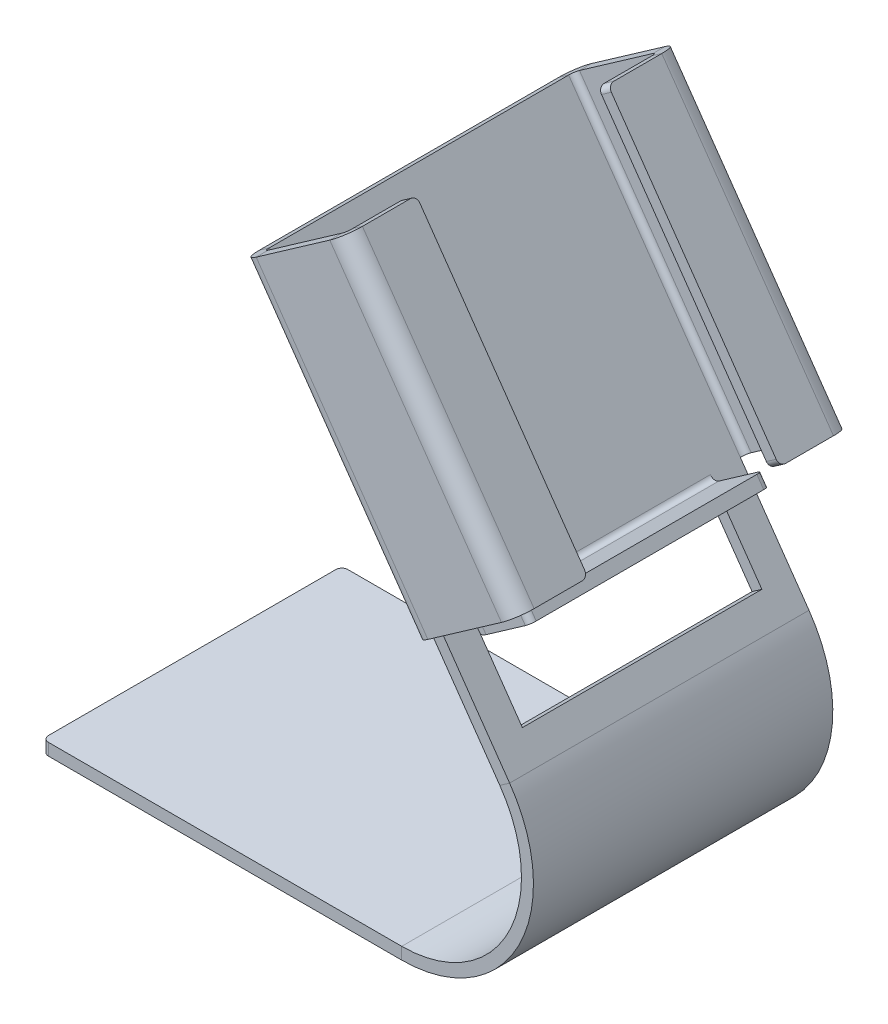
ISO-10303-21;
HEADER;
FILE_DESCRIPTION(('STEP AP214'),'2;1');
FILE_NAME('part.step','',(''),(''),'','','');
FILE_SCHEMA(('AUTOMOTIVE_DESIGN { 1 0 10303 214 1 1 1 1 }'));
ENDSEC;
DATA;
#1=APPLICATION_CONTEXT('core data for automotive mechanical design processes');
#2=APPLICATION_PROTOCOL_DEFINITION('international standard','automotive_design',2000,#1);
#3=PRODUCT_CONTEXT('',#1,'mechanical');
#4=PRODUCT('Part','Part','',(#3));
#5=PRODUCT_RELATED_PRODUCT_CATEGORY('part','',(#4));
#6=PRODUCT_DEFINITION_FORMATION('','',#4);
#7=PRODUCT_DEFINITION_CONTEXT('part definition',#1,'design');
#8=PRODUCT_DEFINITION('design','',#6,#7);
#9=PRODUCT_DEFINITION_SHAPE('','',#8);
#10=(LENGTH_UNIT() NAMED_UNIT(*) SI_UNIT(.MILLI.,.METRE.));
#11=(NAMED_UNIT(*) PLANE_ANGLE_UNIT() SI_UNIT($,.RADIAN.));
#12=(NAMED_UNIT(*) SI_UNIT($,.STERADIAN.) SOLID_ANGLE_UNIT());
#13=UNCERTAINTY_MEASURE_WITH_UNIT(LENGTH_MEASURE(1.E-05),#10,'distance_accuracy_value','');
#14=(GEOMETRIC_REPRESENTATION_CONTEXT(3) GLOBAL_UNCERTAINTY_ASSIGNED_CONTEXT((#13)) GLOBAL_UNIT_ASSIGNED_CONTEXT((#10,
#11,#12)) REPRESENTATION_CONTEXT('',''));
#15=CARTESIAN_POINT('',(0.,0.,0.));
#16=DIRECTION('',(0.,0.,1.));
#17=DIRECTION('',(1.,0.,0.));
#18=AXIS2_PLACEMENT_3D('',#15,#16,#17);
#19=CARTESIAN_POINT('',(60.,20.,0.));
#20=DIRECTION('',(0.,0.,1.));
#21=DIRECTION('',(1.,0.,0.));
#22=AXIS2_PLACEMENT_3D('',#19,#20,#21);
#23=PLANE('',#22);
#24=DIRECTION('',(-0.819152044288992,-0.573576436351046,0.));
#25=VECTOR('',#24,1.);
#26=CARTESIAN_POINT('',(66.5498162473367,49.0017224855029,0.));
#27=LINE('',#26,#25);
#28=CARTESIAN_POINT('',(66.5498162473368,49.0017224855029,0.));
#29=VERTEX_POINT('',#28);
#30=CARTESIAN_POINT('',(64.9115121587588,47.8545696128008,0.));
#31=VERTEX_POINT('',#30);
#32=EDGE_CURVE('E612',#29,#31,#27,.T.);
#33=ORIENTED_EDGE('',*,*,#32,.F.);
#34=DIRECTION('',(-0.57357643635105,0.819152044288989,0.));
#35=VECTOR('',#34,1.);
#36=CARTESIAN_POINT('',(78.0213449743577,32.6186815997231,0.));
#37=LINE('',#36,#35);
#38=CARTESIAN_POINT('',(78.0213449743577,32.6186815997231,0.));
#39=VERTEX_POINT('',#38);
#40=EDGE_CURVE('E994',#39,#29,#37,.T.);
#41=ORIENTED_EDGE('',*,*,#40,.F.);
#42=DIRECTION('',(-0.819152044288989,-0.57357643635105,0.));
#43=VECTOR('',#42,1.);
#44=CARTESIAN_POINT('',(78.0213449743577,32.6186815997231,0.));
#45=LINE('',#44,#43);
#46=CARTESIAN_POINT('',(76.3830408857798,31.471528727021,0.));
#47=VERTEX_POINT('',#46);
#48=EDGE_CURVE('E1047',#39,#47,#45,.T.);
#49=ORIENTED_EDGE('',*,*,#48,.T.);
#50=DIRECTION('',(-0.57357643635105,0.819152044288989,0.));
#51=VECTOR('',#50,1.);
#52=CARTESIAN_POINT('',(76.3830408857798,31.471528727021,0.));
#53=LINE('',#52,#51);
#54=EDGE_CURVE('E618',#47,#31,#53,.T.);
#55=ORIENTED_EDGE('',*,*,#54,.T.);
#56=EDGE_LOOP('',(#33,#41,#49,#55));
#57=FACE_BOUND('',#56,.T.);
#58=ADVANCED_FACE('F134',(#57),#23,.F.);
#59=CARTESIAN_POINT('',(60.,-1.99999999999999,50.));
#60=DIRECTION('',(0.,0.,1.));
#61=DIRECTION('',(1.,0.,0.));
#62=AXIS2_PLACEMENT_3D('',#59,#60,#61);
#63=PLANE('',#62);
#64=DIRECTION('',(-0.57357643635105,0.819152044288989,0.));
#65=VECTOR('',#64,1.);
#66=CARTESIAN_POINT('',(78.0213449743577,32.6186815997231,50.));
#67=LINE('',#66,#65);
#68=CARTESIAN_POINT('',(78.0213449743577,32.6186815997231,50.));
#69=VERTEX_POINT('',#68);
#70=CARTESIAN_POINT('',(66.5498162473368,49.0017224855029,50.));
#71=VERTEX_POINT('',#70);
#72=EDGE_CURVE('E1023',#69,#71,#67,.T.);
#73=ORIENTED_EDGE('',*,*,#72,.T.);
#74=DIRECTION('',(-0.819152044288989,-0.573576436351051,0.));
#75=VECTOR('',#74,1.);
#76=CARTESIAN_POINT('',(66.5498162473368,49.0017224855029,50.));
#77=LINE('',#76,#75);
#78=CARTESIAN_POINT('',(64.9115121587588,47.8545696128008,50.));
#79=VERTEX_POINT('',#78);
#80=EDGE_CURVE('E954',#71,#79,#77,.T.);
#81=ORIENTED_EDGE('',*,*,#80,.T.);
#82=DIRECTION('',(-0.57357643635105,0.819152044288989,0.));
#83=VECTOR('',#82,1.);
#84=CARTESIAN_POINT('',(76.3830408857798,31.471528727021,50.));
#85=LINE('',#84,#83);
#86=CARTESIAN_POINT('',(76.3830408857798,31.471528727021,50.));
#87=VERTEX_POINT('',#86);
#88=EDGE_CURVE('E1056',#87,#79,#85,.T.);
#89=ORIENTED_EDGE('',*,*,#88,.F.);
#90=DIRECTION('',(0.819152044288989,0.57357643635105,0.));
#91=VECTOR('',#90,1.);
#92=CARTESIAN_POINT('',(76.3830408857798,31.471528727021,50.));
#93=LINE('',#92,#91);
#94=EDGE_CURVE('E641',#87,#69,#93,.T.);
#95=ORIENTED_EDGE('',*,*,#94,.T.);
#96=EDGE_LOOP('',(#73,#81,#89,#95));
#97=FACE_BOUND('',#96,.T.);
#98=ADVANCED_FACE('F752',(#97),#63,.T.);
#99=CARTESIAN_POINT('',(76.3830408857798,31.471528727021,50.));
#100=DIRECTION('',(0.,0.,1.));
#101=DIRECTION('',(1.,0.,0.));
#102=AXIS2_PLACEMENT_3D('',#99,#100,#101);
#103=PLANE('',#102);
#104=ORIENTED_EDGE('',*,*,#94,.F.);
#105=CARTESIAN_POINT('',(60.,20.,50.));
#106=DIRECTION('',(0.,0.,1.));
#107=DIRECTION('',(1.,0.,0.));
#108=AXIS2_PLACEMENT_3D('',#105,#106,#107);
#109=CIRCLE('',#108,20.);
#110=CARTESIAN_POINT('',(60.,0.,50.));
#111=VERTEX_POINT('',#110);
#112=EDGE_CURVE('E1060',#111,#87,#109,.T.);
#113=ORIENTED_EDGE('',*,*,#112,.F.);
#114=DIRECTION('',(0.,1.,0.));
#115=VECTOR('',#114,1.);
#116=CARTESIAN_POINT('',(60.,-1.99999999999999,50.));
#117=LINE('',#116,#115);
#118=CARTESIAN_POINT('',(60.,-1.99999999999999,50.));
#119=VERTEX_POINT('',#118);
#120=EDGE_CURVE('E1052',#119,#111,#117,.T.);
#121=ORIENTED_EDGE('',*,*,#120,.F.);
#122=CARTESIAN_POINT('',(60.,20.,50.));
#123=DIRECTION('',(0.,0.,1.));
#124=DIRECTION('',(1.,0.,0.));
#125=AXIS2_PLACEMENT_3D('',#122,#123,#124);
#126=CIRCLE('',#125,22.);
#127=EDGE_CURVE('E1008',#119,#69,#126,.T.);
#128=ORIENTED_EDGE('',*,*,#127,.T.);
#129=EDGE_LOOP('',(#104,#113,#121,#128));
#130=FACE_BOUND('',#129,.T.);
#131=ADVANCED_FACE('F758',(#130),#103,.T.);
#132=CARTESIAN_POINT('',(60.,0.,0.));
#133=DIRECTION('',(0.,0.,-1.));
#134=DIRECTION('',(-1.,0.,0.));
#135=AXIS2_PLACEMENT_3D('',#132,#133,#134);
#136=PLANE('',#135);
#137=DIRECTION('',(0.,-1.,0.));
#138=VECTOR('',#137,1.);
#139=CARTESIAN_POINT('',(60.,0.,0.));
#140=LINE('',#139,#138);
#141=CARTESIAN_POINT('',(60.,0.,0.));
#142=VERTEX_POINT('',#141);
#143=CARTESIAN_POINT('',(60.,-1.99999999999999,0.));
#144=VERTEX_POINT('',#143);
#145=EDGE_CURVE('E1049',#142,#144,#140,.T.);
#146=ORIENTED_EDGE('',*,*,#145,.F.);
#147=CARTESIAN_POINT('',(60.,20.,0.));
#148=DIRECTION('',(0.,0.,1.));
#149=DIRECTION('',(1.,0.,0.));
#150=AXIS2_PLACEMENT_3D('',#147,#148,#149);
#151=CIRCLE('',#150,20.);
#152=EDGE_CURVE('E1013',#142,#47,#151,.T.);
#153=ORIENTED_EDGE('',*,*,#152,.T.);
#154=ORIENTED_EDGE('',*,*,#48,.F.);
#155=CARTESIAN_POINT('',(60.,20.,0.));
#156=DIRECTION('',(0.,0.,1.));
#157=DIRECTION('',(1.,0.,0.));
#158=AXIS2_PLACEMENT_3D('',#155,#156,#157);
#159=CIRCLE('',#158,22.);
#160=EDGE_CURVE('E1020',#144,#39,#159,.T.);
#161=ORIENTED_EDGE('',*,*,#160,.F.);
#162=EDGE_LOOP('',(#146,#153,#154,#161));
#163=FACE_BOUND('',#162,.T.);
#164=ADVANCED_FACE('F800',(#163),#136,.T.);
#165=CARTESIAN_POINT('',(78.0213449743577,32.6186815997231,0.));
#166=DIRECTION('',(0.,0.,-1.));
#167=DIRECTION('',(-1.,0.,0.));
#168=AXIS2_PLACEMENT_3D('',#165,#166,#167);
#169=PLANE('',#168);
#170=DIRECTION('',(1.,0.,0.));
#171=VECTOR('',#170,1.);
#172=CARTESIAN_POINT('',(0.,-2.,0.));
#173=LINE('',#172,#171);
#174=CARTESIAN_POINT('',(1.,-2.,0.));
#175=VERTEX_POINT('',#174);
#176=EDGE_CURVE('E1018',#175,#144,#173,.T.);
#177=ORIENTED_EDGE('',*,*,#176,.F.);
#178=DIRECTION('',(0.,1.,0.));
#179=VECTOR('',#178,1.);
#180=CARTESIAN_POINT('',(1.,32.6186815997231,0.));
#181=LINE('',#180,#179);
#182=CARTESIAN_POINT('',(1.,0.,0.));
#183=VERTEX_POINT('',#182);
#184=EDGE_CURVE('E637',#175,#183,#181,.T.);
#185=ORIENTED_EDGE('',*,*,#184,.T.);
#186=DIRECTION('',(1.,0.,0.));
#187=VECTOR('',#186,1.);
#188=CARTESIAN_POINT('',(0.,0.,0.));
#189=LINE('',#188,#187);
#190=EDGE_CURVE('E1016',#183,#142,#189,.T.);
#191=ORIENTED_EDGE('',*,*,#190,.T.);
#192=ORIENTED_EDGE('',*,*,#145,.T.);
#193=EDGE_LOOP('',(#177,#185,#191,#192));
#194=FACE_BOUND('',#193,.T.);
#195=ADVANCED_FACE('F796',(#194),#169,.T.);
#196=CARTESIAN_POINT('',(78.0213449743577,32.6186815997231,50.));
#197=DIRECTION('',(-0.819152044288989,-0.57357643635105,0.));
#198=DIRECTION('',(0.57357643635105,-0.819152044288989,0.));
#199=AXIS2_PLACEMENT_3D('',#196,#197,#198);
#200=PLANE('',#199);
#201=DIRECTION('',(-0.57357643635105,0.819152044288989,0.));
#202=VECTOR('',#201,1.);
#203=CARTESIAN_POINT('',(66.5498162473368,49.0017224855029,5.));
#204=LINE('',#203,#202);
#205=CARTESIAN_POINT('',(75.1534627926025,36.7144418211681,5.));
#206=VERTEX_POINT('',#205);
#207=CARTESIAN_POINT('',(66.5498162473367,49.0017224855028,5.));
#208=VERTEX_POINT('',#207);
#209=EDGE_CURVE('E477',#206,#208,#204,.T.);
#210=ORIENTED_EDGE('',*,*,#209,.F.);
#211=DIRECTION('',(0.,0.,-1.));
#212=VECTOR('',#211,1.);
#213=CARTESIAN_POINT('',(75.1534627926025,36.7144418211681,45.));
#214=LINE('',#213,#212);
#215=CARTESIAN_POINT('',(75.1534627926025,36.7144418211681,45.));
#216=VERTEX_POINT('',#215);
#217=EDGE_CURVE('E480',#216,#206,#214,.T.);
#218=ORIENTED_EDGE('',*,*,#217,.F.);
#219=DIRECTION('',(0.57357643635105,-0.819152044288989,0.));
#220=VECTOR('',#219,1.);
#221=CARTESIAN_POINT('',(66.5498162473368,49.0017224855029,45.));
#222=LINE('',#221,#220);
#223=CARTESIAN_POINT('',(66.5498162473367,49.001722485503,45.));
#224=VERTEX_POINT('',#223);
#225=EDGE_CURVE('E473',#224,#216,#222,.T.);
#226=ORIENTED_EDGE('',*,*,#225,.F.);
#227=DIRECTION('',(0.,0.,1.));
#228=VECTOR('',#227,1.);
#229=CARTESIAN_POINT('',(66.5498162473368,49.0017224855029,45.));
#230=LINE('',#229,#228);
#231=EDGE_CURVE('E474',#208,#224,#230,.T.);
#232=ORIENTED_EDGE('',*,*,#231,.F.);
#233=EDGE_LOOP('',(#210,#218,#226,#232));
#234=FACE_BOUND('',#233,.T.);
#235=ORIENTED_EDGE('',*,*,#40,.T.);
#236=DIRECTION('',(-0.57357643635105,0.819152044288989,0.));
#237=VECTOR('',#236,1.);
#238=CARTESIAN_POINT('',(37.8709944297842,89.9593246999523,0.));
#239=LINE('',#238,#237);
#240=CARTESIAN_POINT('',(37.8709944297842,89.9593246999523,0.));
#241=VERTEX_POINT('',#240);
#242=EDGE_CURVE('E606',#241,#29,#239,.F.);
#243=ORIENTED_EDGE('',*,*,#242,.F.);
#244=DIRECTION('',(0.,0.,-1.));
#245=VECTOR('',#244,1.);
#246=CARTESIAN_POINT('',(37.8709944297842,89.9593246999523,50.));
#247=LINE('',#246,#245);
#248=CARTESIAN_POINT('',(37.8709944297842,89.9593246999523,50.));
#249=VERTEX_POINT('',#248);
#250=EDGE_CURVE('E1044',#249,#241,#247,.T.);
#251=ORIENTED_EDGE('',*,*,#250,.F.);
#252=DIRECTION('',(0.573576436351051,-0.819152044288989,0.));
#253=VECTOR('',#252,1.);
#254=CARTESIAN_POINT('',(66.5498162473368,49.0017224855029,50.));
#255=LINE('',#254,#253);
#256=EDGE_CURVE('E956',#71,#249,#255,.F.);
#257=ORIENTED_EDGE('',*,*,#256,.F.);
#258=ORIENTED_EDGE('',*,*,#72,.F.);
#259=DIRECTION('',(0.,0.,-1.));
#260=VECTOR('',#259,1.);
#261=CARTESIAN_POINT('',(78.0213449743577,32.6186815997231,50.));
#262=LINE('',#261,#260);
#263=EDGE_CURVE('E1024',#69,#39,#262,.T.);
#264=ORIENTED_EDGE('',*,*,#263,.T.);
#265=EDGE_LOOP('',(#235,#243,#251,#257,#258,#264));
#266=FACE_BOUND('',#265,.T.);
#267=ADVANCED_FACE('F792',(#234,#266),#200,.F.);
#268=CARTESIAN_POINT('',(36.2326903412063,88.8121718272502,50.));
#269=DIRECTION('',(-0.573576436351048,0.81915204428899,0.));
#270=DIRECTION('',(-0.81915204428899,-0.573576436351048,0.));
#271=AXIS2_PLACEMENT_3D('',#268,#269,#270);
#272=PLANE('',#271);
#273=DIRECTION('',(0.81915204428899,0.573576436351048,0.));
#274=VECTOR('',#273,1.);
#275=CARTESIAN_POINT('',(36.2326903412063,88.8121718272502,0.));
#276=LINE('',#275,#274);
#277=CARTESIAN_POINT('',(36.2326903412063,88.8121718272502,0.));
#278=VERTEX_POINT('',#277);
#279=EDGE_CURVE('E1004',#278,#241,#276,.T.);
#280=ORIENTED_EDGE('',*,*,#279,.F.);
#281=DIRECTION('',(0.,0.,-1.));
#282=VECTOR('',#281,1.);
#283=CARTESIAN_POINT('',(36.2326903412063,88.8121718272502,50.));
#284=LINE('',#283,#282);
#285=CARTESIAN_POINT('',(36.2326903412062,88.8121718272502,50.));
#286=VERTEX_POINT('',#285);
#287=EDGE_CURVE('E1042',#286,#278,#284,.T.);
#288=ORIENTED_EDGE('',*,*,#287,.F.);
#289=DIRECTION('',(0.81915204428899,0.573576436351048,0.));
#290=VECTOR('',#289,1.);
#291=CARTESIAN_POINT('',(36.2326903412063,88.8121718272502,50.));
#292=LINE('',#291,#290);
#293=EDGE_CURVE('E1061',#286,#249,#292,.T.);
#294=ORIENTED_EDGE('',*,*,#293,.T.);
#295=ORIENTED_EDGE('',*,*,#250,.T.);
#296=EDGE_LOOP('',(#280,#288,#294,#295));
#297=FACE_BOUND('',#296,.T.);
#298=ADVANCED_FACE('F788',(#297),#272,.T.);
#299=CARTESIAN_POINT('',(76.3830408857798,31.471528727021,50.));
#300=DIRECTION('',(-0.819152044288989,-0.57357643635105,0.));
#301=DIRECTION('',(0.57357643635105,-0.819152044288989,0.));
#302=AXIS2_PLACEMENT_3D('',#299,#300,#301);
#303=PLANE('',#302);
#304=DIRECTION('',(0.,0.,-1.));
#305=VECTOR('',#304,1.);
#306=CARTESIAN_POINT('',(73.5151587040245,35.5672889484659,45.));
#307=LINE('',#306,#305);
#308=CARTESIAN_POINT('',(73.5151587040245,35.5672889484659,45.));
#309=VERTEX_POINT('',#308);
#310=CARTESIAN_POINT('',(73.5151587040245,35.567288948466,5.));
#311=VERTEX_POINT('',#310);
#312=EDGE_CURVE('E463',#309,#311,#307,.T.);
#313=ORIENTED_EDGE('',*,*,#312,.T.);
#314=DIRECTION('',(-0.57357643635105,0.819152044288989,0.));
#315=VECTOR('',#314,1.);
#316=CARTESIAN_POINT('',(64.9115121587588,47.8545696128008,5.));
#317=LINE('',#316,#315);
#318=CARTESIAN_POINT('',(64.9115121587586,47.8545696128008,5.00000000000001));
#319=VERTEX_POINT('',#318);
#320=EDGE_CURVE('E469',#311,#319,#317,.T.);
#321=ORIENTED_EDGE('',*,*,#320,.T.);
#322=DIRECTION('',(0.,0.,1.));
#323=VECTOR('',#322,1.);
#324=CARTESIAN_POINT('',(64.9115121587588,47.8545696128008,45.));
#325=LINE('',#324,#323);
#326=CARTESIAN_POINT('',(64.9115121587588,47.8545696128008,45.));
#327=VERTEX_POINT('',#326);
#328=EDGE_CURVE('E412',#319,#327,#325,.T.);
#329=ORIENTED_EDGE('',*,*,#328,.T.);
#330=DIRECTION('',(0.57357643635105,-0.819152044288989,0.));
#331=VECTOR('',#330,1.);
#332=CARTESIAN_POINT('',(64.9115121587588,47.8545696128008,45.));
#333=LINE('',#332,#331);
#334=EDGE_CURVE('E458',#327,#309,#333,.T.);
#335=ORIENTED_EDGE('',*,*,#334,.T.);
#336=EDGE_LOOP('',(#313,#321,#329,#335));
#337=FACE_BOUND('',#336,.T.);
#338=ORIENTED_EDGE('',*,*,#54,.F.);
#339=DIRECTION('',(0.,0.,-1.));
#340=VECTOR('',#339,1.);
#341=CARTESIAN_POINT('',(76.3830408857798,31.471528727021,50.));
#342=LINE('',#341,#340);
#343=EDGE_CURVE('E1039',#87,#47,#342,.T.);
#344=ORIENTED_EDGE('',*,*,#343,.F.);
#345=ORIENTED_EDGE('',*,*,#88,.T.);
#346=DIRECTION('',(0.573576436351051,-0.819152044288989,0.));
#347=VECTOR('',#346,1.);
#348=CARTESIAN_POINT('',(64.9115121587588,47.8545696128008,50.));
#349=LINE('',#348,#347);
#350=EDGE_CURVE('E983',#79,#286,#349,.F.);
#351=ORIENTED_EDGE('',*,*,#350,.T.);
#352=ORIENTED_EDGE('',*,*,#287,.T.);
#353=DIRECTION('',(-0.57357643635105,0.819152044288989,0.));
#354=VECTOR('',#353,1.);
#355=CARTESIAN_POINT('',(36.2326903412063,88.8121718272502,0.));
#356=LINE('',#355,#354);
#357=EDGE_CURVE('E602',#278,#31,#356,.F.);
#358=ORIENTED_EDGE('',*,*,#357,.T.);
#359=EDGE_LOOP('',(#338,#344,#345,#351,#352,#358));
#360=FACE_BOUND('',#359,.T.);
#361=ADVANCED_FACE('F784',(#337,#360),#303,.T.);
#362=CARTESIAN_POINT('',(60.,20.,50.));
#363=DIRECTION('',(0.,0.,-1.));
#364=DIRECTION('',(-1.,0.,0.));
#365=AXIS2_PLACEMENT_3D('',#362,#363,#364);
#366=CYLINDRICAL_SURFACE('',#365,20.);
#367=ORIENTED_EDGE('',*,*,#152,.F.);
#368=DIRECTION('',(0.,0.,-1.));
#369=VECTOR('',#368,1.);
#370=CARTESIAN_POINT('',(60.,0.,50.));
#371=LINE('',#370,#369);
#372=EDGE_CURVE('E1036',#111,#142,#371,.T.);
#373=ORIENTED_EDGE('',*,*,#372,.F.);
#374=ORIENTED_EDGE('',*,*,#112,.T.);
#375=ORIENTED_EDGE('',*,*,#343,.T.);
#376=EDGE_LOOP('',(#367,#373,#374,#375));
#377=FACE_BOUND('',#376,.T.);
#378=ADVANCED_FACE('F780',(#377),#366,.F.);
#379=CARTESIAN_POINT('',(0.,0.,50.));
#380=DIRECTION('',(0.,1.,0.));
#381=DIRECTION('',(0.,0.,1.));
#382=AXIS2_PLACEMENT_3D('',#379,#380,#381);
#383=PLANE('',#382);
#384=ORIENTED_EDGE('',*,*,#190,.F.);
#385=CARTESIAN_POINT('',(1.,0.,1.));
#386=DIRECTION('',(0.,1.,0.));
#387=DIRECTION('',(0.,0.,1.));
#388=AXIS2_PLACEMENT_3D('',#385,#386,#387);
#389=CIRCLE('',#388,1.);
#390=CARTESIAN_POINT('',(0.,0.,1.));
#391=VERTEX_POINT('',#390);
#392=EDGE_CURVE('E643',#183,#391,#389,.T.);
#393=ORIENTED_EDGE('',*,*,#392,.T.);
#394=DIRECTION('',(0.,0.,-1.));
#395=VECTOR('',#394,1.);
#396=CARTESIAN_POINT('',(0.,0.,50.));
#397=LINE('',#396,#395);
#398=CARTESIAN_POINT('',(0.,0.,49.));
#399=VERTEX_POINT('',#398);
#400=EDGE_CURVE('E1033',#399,#391,#397,.T.);
#401=ORIENTED_EDGE('',*,*,#400,.F.);
#402=CARTESIAN_POINT('',(1.,0.,49.));
#403=DIRECTION('',(0.,1.,0.));
#404=DIRECTION('',(0.,0.,1.));
#405=AXIS2_PLACEMENT_3D('',#402,#403,#404);
#406=CIRCLE('',#405,1.);
#407=CARTESIAN_POINT('',(1.,0.,50.));
#408=VERTEX_POINT('',#407);
#409=EDGE_CURVE('E640',#399,#408,#406,.T.);
#410=ORIENTED_EDGE('',*,*,#409,.T.);
#411=DIRECTION('',(1.,0.,0.));
#412=VECTOR('',#411,1.);
#413=CARTESIAN_POINT('',(0.,0.,50.));
#414=LINE('',#413,#412);
#415=EDGE_CURVE('E1067',#408,#111,#414,.T.);
#416=ORIENTED_EDGE('',*,*,#415,.T.);
#417=ORIENTED_EDGE('',*,*,#372,.T.);
#418=EDGE_LOOP('',(#384,#393,#401,#410,#416,#417));
#419=FACE_BOUND('',#418,.T.);
#420=ADVANCED_FACE('F776',(#419),#383,.T.);
#421=CARTESIAN_POINT('',(0.,-2.,50.));
#422=DIRECTION('',(-1.,0.,0.));
#423=DIRECTION('',(0.,0.,1.));
#424=AXIS2_PLACEMENT_3D('',#421,#422,#423);
#425=PLANE('',#424);
#426=ORIENTED_EDGE('',*,*,#400,.T.);
#427=DIRECTION('',(0.,1.,0.));
#428=VECTOR('',#427,1.);
#429=CARTESIAN_POINT('',(0.,-2.,1.));
#430=LINE('',#429,#428);
#431=CARTESIAN_POINT('',(0.,-2.,1.));
#432=VERTEX_POINT('',#431);
#433=EDGE_CURVE('E648',#391,#432,#430,.F.);
#434=ORIENTED_EDGE('',*,*,#433,.T.);
#435=DIRECTION('',(0.,0.,-1.));
#436=VECTOR('',#435,1.);
#437=CARTESIAN_POINT('',(0.,-2.,50.));
#438=LINE('',#437,#436);
#439=CARTESIAN_POINT('',(0.,-2.,49.));
#440=VERTEX_POINT('',#439);
#441=EDGE_CURVE('E1030',#440,#432,#438,.T.);
#442=ORIENTED_EDGE('',*,*,#441,.F.);
#443=DIRECTION('',(0.,1.,0.));
#444=VECTOR('',#443,1.);
#445=CARTESIAN_POINT('',(0.,-2.,49.));
#446=LINE('',#445,#444);
#447=EDGE_CURVE('E645',#440,#399,#446,.T.);
#448=ORIENTED_EDGE('',*,*,#447,.T.);
#449=EDGE_LOOP('',(#426,#434,#442,#448));
#450=FACE_BOUND('',#449,.T.);
#451=ADVANCED_FACE('F772',(#450),#425,.T.);
#452=CARTESIAN_POINT('',(0.,-2.,50.));
#453=DIRECTION('',(0.,1.,0.));
#454=DIRECTION('',(0.,0.,1.));
#455=AXIS2_PLACEMENT_3D('',#452,#453,#454);
#456=PLANE('',#455);
#457=ORIENTED_EDGE('',*,*,#441,.T.);
#458=CARTESIAN_POINT('',(1.,-2.,1.));
#459=DIRECTION('',(0.,1.,0.));
#460=DIRECTION('',(0.,0.,1.));
#461=AXIS2_PLACEMENT_3D('',#458,#459,#460);
#462=CIRCLE('',#461,1.);
#463=EDGE_CURVE('E652',#432,#175,#462,.F.);
#464=ORIENTED_EDGE('',*,*,#463,.T.);
#465=ORIENTED_EDGE('',*,*,#176,.T.);
#466=DIRECTION('',(0.,0.,-1.));
#467=VECTOR('',#466,1.);
#468=CARTESIAN_POINT('',(60.,-1.99999999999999,50.));
#469=LINE('',#468,#467);
#470=EDGE_CURVE('E1027',#119,#144,#469,.T.);
#471=ORIENTED_EDGE('',*,*,#470,.F.);
#472=DIRECTION('',(1.,0.,0.));
#473=VECTOR('',#472,1.);
#474=CARTESIAN_POINT('',(0.,-2.,50.));
#475=LINE('',#474,#473);
#476=CARTESIAN_POINT('',(1.,-2.,50.));
#477=VERTEX_POINT('',#476);
#478=EDGE_CURVE('E1068',#477,#119,#475,.T.);
#479=ORIENTED_EDGE('',*,*,#478,.F.);
#480=CARTESIAN_POINT('',(1.,-2.,49.));
#481=DIRECTION('',(0.,1.,0.));
#482=DIRECTION('',(0.,0.,1.));
#483=AXIS2_PLACEMENT_3D('',#480,#481,#482);
#484=CIRCLE('',#483,1.);
#485=EDGE_CURVE('E650',#477,#440,#484,.F.);
#486=ORIENTED_EDGE('',*,*,#485,.T.);
#487=EDGE_LOOP('',(#457,#464,#465,#471,#479,#486));
#488=FACE_BOUND('',#487,.T.);
#489=ADVANCED_FACE('F768',(#488),#456,.F.);
#490=CARTESIAN_POINT('',(60.,20.,50.));
#491=DIRECTION('',(0.,0.,-1.));
#492=DIRECTION('',(-1.,0.,0.));
#493=AXIS2_PLACEMENT_3D('',#490,#491,#492);
#494=CYLINDRICAL_SURFACE('',#493,22.);
#495=ORIENTED_EDGE('',*,*,#160,.T.);
#496=ORIENTED_EDGE('',*,*,#263,.F.);
#497=ORIENTED_EDGE('',*,*,#127,.F.);
#498=ORIENTED_EDGE('',*,*,#470,.T.);
#499=EDGE_LOOP('',(#495,#496,#497,#498));
#500=FACE_BOUND('',#499,.T.);
#501=ADVANCED_FACE('F765',(#500),#494,.T.);
#502=CARTESIAN_POINT('',(60.,20.,50.));
#503=DIRECTION('',(0.,0.,1.));
#504=DIRECTION('',(1.,0.,0.));
#505=AXIS2_PLACEMENT_3D('',#502,#503,#504);
#506=PLANE('',#505);
#507=ORIENTED_EDGE('',*,*,#415,.F.);
#508=DIRECTION('',(0.,1.,0.));
#509=VECTOR('',#508,1.);
#510=CARTESIAN_POINT('',(1.,20.,50.));
#511=LINE('',#510,#509);
#512=EDGE_CURVE('E654',#408,#477,#511,.F.);
#513=ORIENTED_EDGE('',*,*,#512,.T.);
#514=ORIENTED_EDGE('',*,*,#478,.T.);
#515=ORIENTED_EDGE('',*,*,#120,.T.);
#516=EDGE_LOOP('',(#507,#513,#514,#515));
#517=FACE_BOUND('',#516,.T.);
#518=ADVANCED_FACE('F763',(#517),#506,.T.);
#519=CARTESIAN_POINT('',(38.6901464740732,90.5329011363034,50.));
#520=DIRECTION('',(-0.573576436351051,0.819152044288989,0.));
#521=DIRECTION('',(-0.819152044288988,-0.573576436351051,0.));
#522=AXIS2_PLACEMENT_3D('',#519,#520,#521);
#523=PLANE('',#522);
#524=DIRECTION('',(0.,0.,-1.));
#525=VECTOR('',#524,1.);
#526=CARTESIAN_POINT('',(38.6901464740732,90.5329011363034,53.));
#527=LINE('',#526,#525);
#528=CARTESIAN_POINT('',(38.6901464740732,90.5329011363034,51.));
#529=VERTEX_POINT('',#528);
#530=CARTESIAN_POINT('',(38.6901464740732,90.5329011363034,53.));
#531=VERTEX_POINT('',#530);
#532=EDGE_CURVE('E616',#529,#531,#527,.F.);
#533=ORIENTED_EDGE('',*,*,#532,.F.);
#534=CARTESIAN_POINT('',(38.6901464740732,90.5329011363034,50.));
#535=DIRECTION('',(0.573576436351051,-0.819152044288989,0.));
#536=DIRECTION('',(0.819152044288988,0.573576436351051,0.));
#537=AXIS2_PLACEMENT_3D('',#534,#535,#536);
#538=CIRCLE('',#537,1.);
#539=EDGE_CURVE('E984',#249,#529,#538,.F.);
#540=ORIENTED_EDGE('',*,*,#539,.F.);
#541=ORIENTED_EDGE('',*,*,#293,.F.);
#542=CARTESIAN_POINT('',(38.6901464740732,90.5329011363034,50.));
#543=DIRECTION('',(0.573576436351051,-0.819152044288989,0.));
#544=DIRECTION('',(0.819152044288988,0.573576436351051,0.));
#545=AXIS2_PLACEMENT_3D('',#542,#543,#544);
#546=CIRCLE('',#545,3.);
#547=EDGE_CURVE('E980',#286,#531,#546,.F.);
#548=ORIENTED_EDGE('',*,*,#547,.T.);
#549=EDGE_LOOP('',(#533,#540,#541,#548));
#550=FACE_BOUND('',#549,.T.);
#551=ADVANCED_FACE('F936',(#550),#523,.T.);
#552=CARTESIAN_POINT('',(67.3689682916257,49.5752989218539,50.));
#553=DIRECTION('',(-0.573576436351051,0.819152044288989,0.));
#554=DIRECTION('',(-0.819152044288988,-0.573576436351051,0.));
#555=AXIS2_PLACEMENT_3D('',#552,#553,#554);
#556=PLANE('',#555);
#557=CARTESIAN_POINT('',(67.3689682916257,49.5752989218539,50.));
#558=DIRECTION('',(0.573576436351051,-0.819152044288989,0.));
#559=DIRECTION('',(0.819152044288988,0.573576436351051,0.));
#560=AXIS2_PLACEMENT_3D('',#557,#558,#559);
#561=CIRCLE('',#560,1.);
#562=CARTESIAN_POINT('',(67.3689682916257,49.5752989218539,51.));
#563=VERTEX_POINT('',#562);
#564=EDGE_CURVE('E949',#563,#71,#561,.T.);
#565=ORIENTED_EDGE('',*,*,#564,.F.);
#566=DIRECTION('',(0.,0.,-1.));
#567=VECTOR('',#566,1.);
#568=CARTESIAN_POINT('',(67.3689682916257,49.5752989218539,51.));
#569=LINE('',#568,#567);
#570=CARTESIAN_POINT('',(67.3689682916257,49.5752989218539,53.));
#571=VERTEX_POINT('',#570);
#572=EDGE_CURVE('E951',#563,#571,#569,.F.);
#573=ORIENTED_EDGE('',*,*,#572,.T.);
#574=CARTESIAN_POINT('',(67.3689682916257,49.5752989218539,50.));
#575=DIRECTION('',(0.573576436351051,-0.819152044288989,0.));
#576=DIRECTION('',(0.819152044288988,0.573576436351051,0.));
#577=AXIS2_PLACEMENT_3D('',#574,#575,#576);
#578=CIRCLE('',#577,3.);
#579=EDGE_CURVE('E987',#571,#79,#578,.T.);
#580=ORIENTED_EDGE('',*,*,#579,.T.);
#581=ORIENTED_EDGE('',*,*,#80,.F.);
#582=EDGE_LOOP('',(#565,#573,#580,#581));
#583=FACE_BOUND('',#582,.T.);
#584=ADVANCED_FACE('F934',(#583),#556,.F.);
#585=CARTESIAN_POINT('',(67.3689682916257,49.5752989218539,50.));
#586=DIRECTION('',(0.573576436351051,-0.819152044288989,0.));
#587=DIRECTION('',(0.,0.,1.));
#588=AXIS2_PLACEMENT_3D('',#585,#586,#587);
#589=CYLINDRICAL_SURFACE('',#588,3.);
#590=ORIENTED_EDGE('',*,*,#350,.F.);
#591=ORIENTED_EDGE('',*,*,#579,.F.);
#592=DIRECTION('',(0.57357643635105,-0.819152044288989,0.));
#593=VECTOR('',#592,1.);
#594=CARTESIAN_POINT('',(38.6901464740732,90.5329011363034,53.));
#595=LINE('',#594,#593);
#596=EDGE_CURVE('E964',#571,#531,#595,.F.);
#597=ORIENTED_EDGE('',*,*,#596,.T.);
#598=ORIENTED_EDGE('',*,*,#547,.F.);
#599=EDGE_LOOP('',(#590,#591,#597,#598));
#600=FACE_BOUND('',#599,.T.);
#601=ADVANCED_FACE('F931',(#600),#589,.T.);
#602=CARTESIAN_POINT('',(67.3689682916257,49.5752989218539,50.));
#603=DIRECTION('',(0.573576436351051,-0.819152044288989,0.));
#604=DIRECTION('',(0.,0.,1.));
#605=AXIS2_PLACEMENT_3D('',#602,#603,#604);
#606=CYLINDRICAL_SURFACE('',#605,1.);
#607=ORIENTED_EDGE('',*,*,#256,.T.);
#608=ORIENTED_EDGE('',*,*,#539,.T.);
#609=DIRECTION('',(0.57357643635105,-0.819152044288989,0.));
#610=VECTOR('',#609,1.);
#611=CARTESIAN_POINT('',(38.6901464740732,90.5329011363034,51.));
#612=LINE('',#611,#610);
#613=EDGE_CURVE('E965',#529,#563,#612,.T.);
#614=ORIENTED_EDGE('',*,*,#613,.T.);
#615=ORIENTED_EDGE('',*,*,#564,.T.);
#616=EDGE_LOOP('',(#607,#608,#614,#615));
#617=FACE_BOUND('',#616,.T.);
#618=ADVANCED_FACE('F929',(#617),#606,.F.);
#619=CARTESIAN_POINT('',(79.6562489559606,58.1789454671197,53.0000000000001));
#620=DIRECTION('',(-0.57357643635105,0.819152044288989,0.));
#621=DIRECTION('',(-0.819152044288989,-0.57357643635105,0.));
#622=AXIS2_PLACEMENT_3D('',#619,#620,#621);
#623=PLANE('',#622);
#624=ORIENTED_EDGE('',*,*,#572,.F.);
#625=DIRECTION('',(-0.819152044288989,-0.57357643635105,0.));
#626=VECTOR('',#625,1.);
#627=CARTESIAN_POINT('',(79.6562489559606,58.1789454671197,51.));
#628=LINE('',#627,#626);
#629=CARTESIAN_POINT('',(79.6562489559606,58.1789454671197,51.0000000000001));
#630=VERTEX_POINT('',#629);
#631=EDGE_CURVE('E960',#563,#630,#628,.F.);
#632=ORIENTED_EDGE('',*,*,#631,.T.);
#633=DIRECTION('',(0.,0.,-1.));
#634=VECTOR('',#633,1.);
#635=CARTESIAN_POINT('',(79.6562489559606,58.1789454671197,53.0000000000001));
#636=LINE('',#635,#634);
#637=CARTESIAN_POINT('',(79.6562489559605,58.1789454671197,53.0000000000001));
#638=VERTEX_POINT('',#637);
#639=EDGE_CURVE('E609',#638,#630,#636,.T.);
#640=ORIENTED_EDGE('',*,*,#639,.F.);
#641=DIRECTION('',(0.819152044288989,0.57357643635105,0.));
#642=VECTOR('',#641,1.);
#643=CARTESIAN_POINT('',(66.5498162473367,49.0017224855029,53.));
#644=LINE('',#643,#642);
#645=EDGE_CURVE('E963',#571,#638,#644,.T.);
#646=ORIENTED_EDGE('',*,*,#645,.F.);
#647=EDGE_LOOP('',(#624,#632,#640,#646));
#648=FACE_BOUND('',#647,.T.);
#649=ADVANCED_FACE('F925',(#648),#623,.F.);
#650=CARTESIAN_POINT('',(37.8709944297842,89.9593246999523,53.));
#651=DIRECTION('',(0.573576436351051,-0.819152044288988,0.));
#652=DIRECTION('',(0.819152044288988,0.573576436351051,0.));
#653=AXIS2_PLACEMENT_3D('',#650,#651,#652);
#654=PLANE('',#653);
#655=ORIENTED_EDGE('',*,*,#532,.T.);
#656=DIRECTION('',(-0.819152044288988,-0.573576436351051,0.));
#657=VECTOR('',#656,1.);
#658=CARTESIAN_POINT('',(37.8709944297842,89.9593246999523,53.));
#659=LINE('',#658,#657);
#660=CARTESIAN_POINT('',(50.977427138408,99.1365476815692,53.0000000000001));
#661=VERTEX_POINT('',#660);
#662=EDGE_CURVE('E1701',#661,#531,#659,.T.);
#663=ORIENTED_EDGE('',*,*,#662,.F.);
#664=DIRECTION('',(0.,0.,-1.));
#665=VECTOR('',#664,1.);
#666=CARTESIAN_POINT('',(50.977427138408,99.1365476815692,53.0000000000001));
#667=LINE('',#666,#665);
#668=CARTESIAN_POINT('',(50.977427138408,99.1365476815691,51.0000000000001));
#669=VERTEX_POINT('',#668);
#670=EDGE_CURVE('E1704',#661,#669,#667,.T.);
#671=ORIENTED_EDGE('',*,*,#670,.T.);
#672=DIRECTION('',(0.819152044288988,0.573576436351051,0.));
#673=VECTOR('',#672,1.);
#674=CARTESIAN_POINT('',(37.8709944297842,89.9593246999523,51.));
#675=LINE('',#674,#673);
#676=EDGE_CURVE('E972',#669,#529,#675,.F.);
#677=ORIENTED_EDGE('',*,*,#676,.T.);
#678=EDGE_LOOP('',(#655,#663,#671,#677));
#679=FACE_BOUND('',#678,.T.);
#680=ADVANCED_FACE('F918',(#679),#654,.F.);
#681=CARTESIAN_POINT('',(66.5498162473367,49.0017224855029,53.));
#682=DIRECTION('',(0.,0.,-1.));
#683=DIRECTION('',(-1.,0.,0.));
#684=AXIS2_PLACEMENT_3D('',#681,#682,#683);
#685=PLANE('',#684);
#686=ORIENTED_EDGE('',*,*,#596,.F.);
#687=ORIENTED_EDGE('',*,*,#645,.T.);
#688=DIRECTION('',(-0.57357643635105,0.819152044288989,0.));
#689=VECTOR('',#688,1.);
#690=CARTESIAN_POINT('',(79.6562489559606,58.1789454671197,53.0000000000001));
#691=LINE('',#690,#689);
#692=EDGE_CURVE('E1697',#638,#661,#691,.T.);
#693=ORIENTED_EDGE('',*,*,#692,.T.);
#694=ORIENTED_EDGE('',*,*,#662,.T.);
#695=EDGE_LOOP('',(#686,#687,#693,#694));
#696=FACE_BOUND('',#695,.T.);
#697=ADVANCED_FACE('F915',(#696),#685,.F.);
#698=CARTESIAN_POINT('',(66.5498162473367,49.0017224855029,51.));
#699=DIRECTION('',(0.,0.,-1.));
#700=DIRECTION('',(-1.,0.,0.));
#701=AXIS2_PLACEMENT_3D('',#698,#699,#700);
#702=PLANE('',#701);
#703=ORIENTED_EDGE('',*,*,#631,.F.);
#704=ORIENTED_EDGE('',*,*,#613,.F.);
#705=ORIENTED_EDGE('',*,*,#676,.F.);
#706=DIRECTION('',(0.57357643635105,-0.819152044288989,0.));
#707=VECTOR('',#706,1.);
#708=CARTESIAN_POINT('',(50.9774271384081,99.1365476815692,51.));
#709=LINE('',#708,#707);
#710=EDGE_CURVE('E970',#630,#669,#709,.F.);
#711=ORIENTED_EDGE('',*,*,#710,.F.);
#712=EDGE_LOOP('',(#703,#704,#705,#711));
#713=FACE_BOUND('',#712,.T.);
#714=ADVANCED_FACE('F910',(#713),#702,.T.);
#715=CARTESIAN_POINT('',(67.3689682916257,49.5752989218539,0.));
#716=DIRECTION('',(0.57357643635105,-0.819152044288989,0.));
#717=DIRECTION('',(0.819152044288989,0.57357643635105,0.));
#718=AXIS2_PLACEMENT_3D('',#715,#716,#717);
#719=PLANE('',#718);
#720=DIRECTION('',(0.,0.,1.));
#721=VECTOR('',#720,1.);
#722=CARTESIAN_POINT('',(67.3689682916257,49.5752989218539,-2.99999999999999));
#723=LINE('',#722,#721);
#724=CARTESIAN_POINT('',(67.3689682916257,49.5752989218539,-1.));
#725=VERTEX_POINT('',#724);
#726=CARTESIAN_POINT('',(67.3689682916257,49.5752989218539,-3.));
#727=VERTEX_POINT('',#726);
#728=EDGE_CURVE('E558',#725,#727,#723,.F.);
#729=ORIENTED_EDGE('',*,*,#728,.F.);
#730=CARTESIAN_POINT('',(67.3689682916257,49.5752989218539,0.));
#731=DIRECTION('',(-0.57357643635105,0.819152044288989,0.));
#732=DIRECTION('',(-0.819152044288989,-0.57357643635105,0.));
#733=AXIS2_PLACEMENT_3D('',#730,#731,#732);
#734=CIRCLE('',#733,1.);
#735=EDGE_CURVE('E603',#29,#725,#734,.F.);
#736=ORIENTED_EDGE('',*,*,#735,.F.);
#737=ORIENTED_EDGE('',*,*,#32,.T.);
#738=CARTESIAN_POINT('',(67.3689682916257,49.5752989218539,0.));
#739=DIRECTION('',(-0.57357643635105,0.819152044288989,0.));
#740=DIRECTION('',(-0.819152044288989,-0.57357643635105,0.));
#741=AXIS2_PLACEMENT_3D('',#738,#739,#740);
#742=CIRCLE('',#741,3.);
#743=EDGE_CURVE('E617',#31,#727,#742,.F.);
#744=ORIENTED_EDGE('',*,*,#743,.T.);
#745=EDGE_LOOP('',(#729,#736,#737,#744));
#746=FACE_BOUND('',#745,.T.);
#747=ADVANCED_FACE('F904',(#746),#719,.T.);
#748=CARTESIAN_POINT('',(38.6901464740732,90.5329011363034,0.));
#749=DIRECTION('',(0.57357643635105,-0.819152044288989,0.));
#750=DIRECTION('',(0.819152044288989,0.57357643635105,0.));
#751=AXIS2_PLACEMENT_3D('',#748,#749,#750);
#752=PLANE('',#751);
#753=CARTESIAN_POINT('',(38.6901464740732,90.5329011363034,0.));
#754=DIRECTION('',(-0.57357643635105,0.819152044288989,0.));
#755=DIRECTION('',(-0.819152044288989,-0.57357643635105,0.));
#756=AXIS2_PLACEMENT_3D('',#753,#754,#755);
#757=CIRCLE('',#756,1.);
#758=CARTESIAN_POINT('',(38.6901464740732,90.5329011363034,-1.));
#759=VERTEX_POINT('',#758);
#760=EDGE_CURVE('E569',#759,#241,#757,.T.);
#761=ORIENTED_EDGE('',*,*,#760,.F.);
#762=DIRECTION('',(0.,0.,1.));
#763=VECTOR('',#762,1.);
#764=CARTESIAN_POINT('',(38.6901464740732,90.5329011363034,-0.999999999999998));
#765=LINE('',#764,#763);
#766=CARTESIAN_POINT('',(38.6901464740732,90.5329011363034,-3.));
#767=VERTEX_POINT('',#766);
#768=EDGE_CURVE('E592',#759,#767,#765,.F.);
#769=ORIENTED_EDGE('',*,*,#768,.T.);
#770=CARTESIAN_POINT('',(38.6901464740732,90.5329011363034,0.));
#771=DIRECTION('',(-0.57357643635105,0.819152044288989,0.));
#772=DIRECTION('',(-0.819152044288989,-0.57357643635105,0.));
#773=AXIS2_PLACEMENT_3D('',#770,#771,#772);
#774=CIRCLE('',#773,3.);
#775=EDGE_CURVE('E599',#767,#278,#774,.T.);
#776=ORIENTED_EDGE('',*,*,#775,.T.);
#777=ORIENTED_EDGE('',*,*,#279,.T.);
#778=EDGE_LOOP('',(#761,#769,#776,#777));
#779=FACE_BOUND('',#778,.T.);
#780=ADVANCED_FACE('F902',(#779),#752,.F.);
#781=CARTESIAN_POINT('',(38.6901464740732,90.5329011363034,0.));
#782=DIRECTION('',(-0.57357643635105,0.819152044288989,0.));
#783=DIRECTION('',(0.,0.,-1.));
#784=AXIS2_PLACEMENT_3D('',#781,#782,#783);
#785=CYLINDRICAL_SURFACE('',#784,3.);
#786=ORIENTED_EDGE('',*,*,#357,.F.);
#787=ORIENTED_EDGE('',*,*,#775,.F.);
#788=DIRECTION('',(-0.57357643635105,0.819152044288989,0.));
#789=VECTOR('',#788,1.);
#790=CARTESIAN_POINT('',(67.3689682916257,49.5752989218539,-3.));
#791=LINE('',#790,#789);
#792=EDGE_CURVE('E590',#767,#727,#791,.F.);
#793=ORIENTED_EDGE('',*,*,#792,.T.);
#794=ORIENTED_EDGE('',*,*,#743,.F.);
#795=EDGE_LOOP('',(#786,#787,#793,#794));
#796=FACE_BOUND('',#795,.T.);
#797=ADVANCED_FACE('F899',(#796),#785,.T.);
#798=CARTESIAN_POINT('',(38.6901464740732,90.5329011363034,0.));
#799=DIRECTION('',(-0.57357643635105,0.819152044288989,0.));
#800=DIRECTION('',(0.,0.,-1.));
#801=AXIS2_PLACEMENT_3D('',#798,#799,#800);
#802=CYLINDRICAL_SURFACE('',#801,1.);
#803=ORIENTED_EDGE('',*,*,#242,.T.);
#804=ORIENTED_EDGE('',*,*,#735,.T.);
#805=DIRECTION('',(-0.57357643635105,0.819152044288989,0.));
#806=VECTOR('',#805,1.);
#807=CARTESIAN_POINT('',(67.3689682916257,49.5752989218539,-1.));
#808=LINE('',#807,#806);
#809=EDGE_CURVE('E595',#725,#759,#808,.T.);
#810=ORIENTED_EDGE('',*,*,#809,.T.);
#811=ORIENTED_EDGE('',*,*,#760,.T.);
#812=EDGE_LOOP('',(#803,#804,#810,#811));
#813=FACE_BOUND('',#812,.T.);
#814=ADVANCED_FACE('F897',(#813),#802,.F.);
#815=CARTESIAN_POINT('',(50.977427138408,99.1365476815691,-3.00000000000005));
#816=DIRECTION('',(0.57357643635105,-0.819152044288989,0.));
#817=DIRECTION('',(0.819152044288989,0.57357643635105,0.));
#818=AXIS2_PLACEMENT_3D('',#815,#816,#817);
#819=PLANE('',#818);
#820=ORIENTED_EDGE('',*,*,#768,.F.);
#821=DIRECTION('',(-0.819152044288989,-0.57357643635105,0.));
#822=VECTOR('',#821,1.);
#823=CARTESIAN_POINT('',(50.9774271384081,99.1365476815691,-1.00000000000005));
#824=LINE('',#823,#822);
#825=CARTESIAN_POINT('',(50.9774271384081,99.1365476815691,-1.00000000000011));
#826=VERTEX_POINT('',#825);
#827=EDGE_CURVE('E587',#759,#826,#824,.F.);
#828=ORIENTED_EDGE('',*,*,#827,.T.);
#829=DIRECTION('',(0.,0.,1.));
#830=VECTOR('',#829,1.);
#831=CARTESIAN_POINT('',(50.977427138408,99.1365476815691,-3.00000000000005));
#832=LINE('',#831,#830);
#833=CARTESIAN_POINT('',(50.977427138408,99.1365476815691,-3.00000000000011));
#834=VERTEX_POINT('',#833);
#835=EDGE_CURVE('E567',#834,#826,#832,.T.);
#836=ORIENTED_EDGE('',*,*,#835,.F.);
#837=DIRECTION('',(0.819152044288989,0.57357643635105,0.));
#838=VECTOR('',#837,1.);
#839=CARTESIAN_POINT('',(37.8709944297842,89.9593246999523,-3.));
#840=LINE('',#839,#838);
#841=EDGE_CURVE('E579',#767,#834,#840,.T.);
#842=ORIENTED_EDGE('',*,*,#841,.F.);
#843=EDGE_LOOP('',(#820,#828,#836,#842));
#844=FACE_BOUND('',#843,.T.);
#845=ADVANCED_FACE('F893',(#844),#819,.F.);
#846=CARTESIAN_POINT('',(66.5498162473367,49.0017224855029,-3.));
#847=DIRECTION('',(-0.57357643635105,0.819152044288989,0.));
#848=DIRECTION('',(-0.819152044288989,-0.57357643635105,0.));
#849=AXIS2_PLACEMENT_3D('',#846,#847,#848);
#850=PLANE('',#849);
#851=ORIENTED_EDGE('',*,*,#728,.T.);
#852=DIRECTION('',(-0.819152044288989,-0.57357643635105,0.));
#853=VECTOR('',#852,1.);
#854=CARTESIAN_POINT('',(66.5498162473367,49.0017224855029,-3.));
#855=LINE('',#854,#853);
#856=CARTESIAN_POINT('',(79.6562489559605,58.1789454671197,-3.00000000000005));
#857=VERTEX_POINT('',#856);
#858=EDGE_CURVE('E573',#857,#727,#855,.T.);
#859=ORIENTED_EDGE('',*,*,#858,.F.);
#860=DIRECTION('',(0.,0.,1.));
#861=VECTOR('',#860,1.);
#862=CARTESIAN_POINT('',(79.6562489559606,58.1789454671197,-3.00000000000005));
#863=LINE('',#862,#861);
#864=CARTESIAN_POINT('',(79.6562489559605,58.1789454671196,-1.00000000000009));
#865=VERTEX_POINT('',#864);
#866=EDGE_CURVE('E570',#857,#865,#863,.T.);
#867=ORIENTED_EDGE('',*,*,#866,.T.);
#868=DIRECTION('',(0.819152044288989,0.57357643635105,0.));
#869=VECTOR('',#868,1.);
#870=CARTESIAN_POINT('',(66.5498162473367,49.0017224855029,-0.999999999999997));
#871=LINE('',#870,#869);
#872=EDGE_CURVE('E582',#865,#725,#871,.F.);
#873=ORIENTED_EDGE('',*,*,#872,.T.);
#874=EDGE_LOOP('',(#851,#859,#867,#873));
#875=FACE_BOUND('',#874,.T.);
#876=ADVANCED_FACE('F886',(#875),#850,.F.);
#877=CARTESIAN_POINT('',(37.8709944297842,89.9593246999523,-3.));
#878=DIRECTION('',(0.,0.,1.));
#879=DIRECTION('',(1.,0.,0.));
#880=AXIS2_PLACEMENT_3D('',#877,#878,#879);
#881=PLANE('',#880);
#882=ORIENTED_EDGE('',*,*,#792,.F.);
#883=ORIENTED_EDGE('',*,*,#841,.T.);
#884=DIRECTION('',(0.57357643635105,-0.819152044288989,0.));
#885=VECTOR('',#884,1.);
#886=CARTESIAN_POINT('',(50.977427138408,99.1365476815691,-3.00000000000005));
#887=LINE('',#886,#885);
#888=EDGE_CURVE('E576',#834,#857,#887,.T.);
#889=ORIENTED_EDGE('',*,*,#888,.T.);
#890=ORIENTED_EDGE('',*,*,#858,.T.);
#891=EDGE_LOOP('',(#882,#883,#889,#890));
#892=FACE_BOUND('',#891,.T.);
#893=ADVANCED_FACE('F883',(#892),#881,.F.);
#894=CARTESIAN_POINT('',(37.8709944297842,89.9593246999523,-0.999999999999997));
#895=DIRECTION('',(0.,0.,1.));
#896=DIRECTION('',(1.,0.,0.));
#897=AXIS2_PLACEMENT_3D('',#894,#895,#896);
#898=PLANE('',#897);
#899=ORIENTED_EDGE('',*,*,#827,.F.);
#900=ORIENTED_EDGE('',*,*,#809,.F.);
#901=ORIENTED_EDGE('',*,*,#872,.F.);
#902=DIRECTION('',(-0.57357643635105,0.819152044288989,0.));
#903=VECTOR('',#902,1.);
#904=CARTESIAN_POINT('',(79.6562489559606,58.1789454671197,-1.00000000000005));
#905=LINE('',#904,#903);
#906=EDGE_CURVE('E585',#826,#865,#905,.F.);
#907=ORIENTED_EDGE('',*,*,#906,.F.);
#908=EDGE_LOOP('',(#899,#900,#901,#907));
#909=FACE_BOUND('',#908,.T.);
#910=ADVANCED_FACE('F879',(#909),#898,.T.);
#911=CARTESIAN_POINT('',(79.6562489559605,58.1789454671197,0.));
#912=DIRECTION('',(0.573576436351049,-0.81915204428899,0.));
#913=DIRECTION('',(0.81915204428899,0.573576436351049,0.));
#914=AXIS2_PLACEMENT_3D('',#911,#912,#913);
#915=PLANE('',#914);
#916=DIRECTION('',(-0.819152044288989,-0.57357643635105,0.));
#917=VECTOR('',#916,1.);
#918=CARTESIAN_POINT('',(82.1137050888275,59.8996747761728,0.));
#919=LINE('',#918,#917);
#920=CARTESIAN_POINT('',(80.4754010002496,58.7525219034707,0.));
#921=VERTEX_POINT('',#920);
#922=CARTESIAN_POINT('',(82.1137050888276,59.8996747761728,0.));
#923=VERTEX_POINT('',#922);
#924=EDGE_CURVE('E523',#921,#923,#919,.F.);
#925=ORIENTED_EDGE('',*,*,#924,.F.);
#926=CARTESIAN_POINT('',(79.6562489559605,58.1789454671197,0.));
#927=DIRECTION('',(-0.573576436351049,0.81915204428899,0.));
#928=DIRECTION('',(-0.81915204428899,-0.573576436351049,0.));
#929=AXIS2_PLACEMENT_3D('',#926,#927,#928);
#930=CIRCLE('',#929,1.00000000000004);
#931=EDGE_CURVE('E562',#865,#921,#930,.F.);
#932=ORIENTED_EDGE('',*,*,#931,.F.);
#933=ORIENTED_EDGE('',*,*,#866,.F.);
#934=CARTESIAN_POINT('',(79.6562489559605,58.1789454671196,0.));
#935=DIRECTION('',(-0.573576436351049,0.81915204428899,0.));
#936=DIRECTION('',(-0.81915204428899,-0.573576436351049,0.));
#937=AXIS2_PLACEMENT_3D('',#934,#935,#936);
#938=CIRCLE('',#937,3.00000000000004);
#939=EDGE_CURVE('E555',#857,#923,#938,.F.);
#940=ORIENTED_EDGE('',*,*,#939,.T.);
#941=EDGE_LOOP('',(#925,#932,#933,#940));
#942=FACE_BOUND('',#941,.T.);
#943=ADVANCED_FACE('F839',(#942),#915,.T.);
#944=CARTESIAN_POINT('',(50.9774271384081,99.1365476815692,0.));
#945=DIRECTION('',(0.573576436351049,-0.81915204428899,0.));
#946=DIRECTION('',(0.81915204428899,0.573576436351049,0.));
#947=AXIS2_PLACEMENT_3D('',#944,#945,#946);
#948=PLANE('',#947);
#949=CARTESIAN_POINT('',(50.9774271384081,99.1365476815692,0.));
#950=DIRECTION('',(-0.573576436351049,0.81915204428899,0.));
#951=DIRECTION('',(-0.81915204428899,-0.573576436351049,0.));
#952=AXIS2_PLACEMENT_3D('',#949,#950,#951);
#953=CIRCLE('',#952,1.00000000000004);
#954=CARTESIAN_POINT('',(51.7965791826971,99.7101241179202,0.));
#955=VERTEX_POINT('',#954);
#956=EDGE_CURVE('E534',#955,#826,#953,.T.);
#957=ORIENTED_EDGE('',*,*,#956,.F.);
#958=DIRECTION('',(-0.819152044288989,-0.57357643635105,0.));
#959=VECTOR('',#958,1.);
#960=CARTESIAN_POINT('',(51.7965791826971,99.7101241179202,0.));
#961=LINE('',#960,#959);
#962=CARTESIAN_POINT('',(53.434883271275,100.857276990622,0.));
#963=VERTEX_POINT('',#962);
#964=EDGE_CURVE('E548',#955,#963,#961,.F.);
#965=ORIENTED_EDGE('',*,*,#964,.T.);
#966=CARTESIAN_POINT('',(50.9774271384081,99.1365476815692,0.));
#967=DIRECTION('',(-0.573576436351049,0.81915204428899,0.));
#968=DIRECTION('',(-0.81915204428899,-0.573576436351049,0.));
#969=AXIS2_PLACEMENT_3D('',#966,#967,#968);
#970=CIRCLE('',#969,3.00000000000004);
#971=EDGE_CURVE('E559',#963,#834,#970,.T.);
#972=ORIENTED_EDGE('',*,*,#971,.T.);
#973=ORIENTED_EDGE('',*,*,#835,.T.);
#974=EDGE_LOOP('',(#957,#965,#972,#973));
#975=FACE_BOUND('',#974,.T.);
#976=ADVANCED_FACE('F873',(#975),#948,.F.);
#977=CARTESIAN_POINT('',(50.9774271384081,99.1365476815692,0.));
#978=DIRECTION('',(-0.573576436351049,0.81915204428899,0.));
#979=DIRECTION('',(0.81915204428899,0.573576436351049,0.));
#980=AXIS2_PLACEMENT_3D('',#977,#978,#979);
#981=CYLINDRICAL_SURFACE('',#980,3.00000000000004);
#982=ORIENTED_EDGE('',*,*,#888,.F.);
#983=ORIENTED_EDGE('',*,*,#971,.F.);
#984=DIRECTION('',(-0.57357643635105,0.819152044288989,0.));
#985=VECTOR('',#984,1.);
#986=CARTESIAN_POINT('',(82.1137050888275,59.8996747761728,0.));
#987=LINE('',#986,#985);
#988=EDGE_CURVE('E545',#963,#923,#987,.F.);
#989=ORIENTED_EDGE('',*,*,#988,.T.);
#990=ORIENTED_EDGE('',*,*,#939,.F.);
#991=EDGE_LOOP('',(#982,#983,#989,#990));
#992=FACE_BOUND('',#991,.T.);
#993=ADVANCED_FACE('F870',(#992),#981,.T.);
#994=CARTESIAN_POINT('',(50.9774271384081,99.1365476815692,0.));
#995=DIRECTION('',(-0.573576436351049,0.81915204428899,0.));
#996=DIRECTION('',(0.81915204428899,0.573576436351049,0.));
#997=AXIS2_PLACEMENT_3D('',#994,#995,#996);
#998=CYLINDRICAL_SURFACE('',#997,1.00000000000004);
#999=ORIENTED_EDGE('',*,*,#906,.T.);
#1000=ORIENTED_EDGE('',*,*,#931,.T.);
#1001=DIRECTION('',(-0.57357643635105,0.819152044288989,0.));
#1002=VECTOR('',#1001,1.);
#1003=CARTESIAN_POINT('',(80.4754010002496,58.7525219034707,0.));
#1004=LINE('',#1003,#1002);
#1005=EDGE_CURVE('E551',#921,#955,#1004,.T.);
#1006=ORIENTED_EDGE('',*,*,#1005,.T.);
#1007=ORIENTED_EDGE('',*,*,#956,.T.);
#1008=EDGE_LOOP('',(#999,#1000,#1006,#1007));
#1009=FACE_BOUND('',#1008,.T.);
#1010=ADVANCED_FACE('F843',(#1009),#998,.F.);
#1011=CARTESIAN_POINT('',(53.4348832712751,100.857276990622,8.99999999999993));
#1012=DIRECTION('',(0.57357643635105,-0.819152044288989,0.));
#1013=DIRECTION('',(0.819152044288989,0.57357643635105,0.));
#1014=AXIS2_PLACEMENT_3D('',#1011,#1012,#1013);
#1015=PLANE('',#1014);
#1016=DIRECTION('',(0.,0.,-1.));
#1017=VECTOR('',#1016,1.);
#1018=CARTESIAN_POINT('',(51.7965791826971,99.7101241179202,8.99999999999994));
#1019=LINE('',#1018,#1017);
#1020=CARTESIAN_POINT('',(51.7965791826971,99.7101241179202,7.99999999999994));
#1021=VERTEX_POINT('',#1020);
#1022=EDGE_CURVE('E543',#955,#1021,#1019,.F.);
#1023=ORIENTED_EDGE('',*,*,#1022,.T.);
#1024=DIRECTION('',(-0.819152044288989,-0.57357643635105,0.));
#1025=VECTOR('',#1024,1.);
#1026=CARTESIAN_POINT('',(53.4348832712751,100.857276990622,7.99999999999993));
#1027=LINE('',#1026,#1025);
#1028=CARTESIAN_POINT('',(53.4348832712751,100.857276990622,7.99999999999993));
#1029=VERTEX_POINT('',#1028);
#1030=EDGE_CURVE('E13',#1021,#1029,#1027,.F.);
#1031=ORIENTED_EDGE('',*,*,#1030,.T.);
#1032=DIRECTION('',(0.,0.,1.));
#1033=VECTOR('',#1032,1.);
#1034=CARTESIAN_POINT('',(53.434883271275,100.857276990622,-1.00000000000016));
#1035=LINE('',#1034,#1033);
#1036=EDGE_CURVE('E537',#963,#1029,#1035,.T.);
#1037=ORIENTED_EDGE('',*,*,#1036,.F.);
#1038=ORIENTED_EDGE('',*,*,#964,.F.);
#1039=EDGE_LOOP('',(#1023,#1031,#1037,#1038));
#1040=FACE_BOUND('',#1039,.T.);
#1041=ADVANCED_FACE('F851',(#1040),#1015,.F.);
#1042=CARTESIAN_POINT('',(82.1137050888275,59.8996747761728,-1.00000000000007));
#1043=DIRECTION('',(-0.57357643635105,0.819152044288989,0.));
#1044=DIRECTION('',(-0.819152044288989,-0.57357643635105,0.));
#1045=AXIS2_PLACEMENT_3D('',#1042,#1043,#1044);
#1046=PLANE('',#1045);
#1047=DIRECTION('',(0.,0.,-1.));
#1048=VECTOR('',#1047,1.);
#1049=CARTESIAN_POINT('',(82.1137050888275,59.8996747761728,-1.00000000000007));
#1050=LINE('',#1049,#1048);
#1051=CARTESIAN_POINT('',(82.1137050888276,59.8996747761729,7.99999999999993));
#1052=VERTEX_POINT('',#1051);
#1053=EDGE_CURVE('E532',#1052,#923,#1050,.T.);
#1054=ORIENTED_EDGE('',*,*,#1053,.F.);
#1055=DIRECTION('',(-0.819152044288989,-0.57357643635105,0.));
#1056=VECTOR('',#1055,1.);
#1057=CARTESIAN_POINT('',(82.1137050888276,59.8996747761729,7.99999999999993));
#1058=LINE('',#1057,#1056);
#1059=CARTESIAN_POINT('',(80.4754010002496,58.7525219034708,7.99999999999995));
#1060=VERTEX_POINT('',#1059);
#1061=EDGE_CURVE('E687',#1052,#1060,#1058,.T.);
#1062=ORIENTED_EDGE('',*,*,#1061,.T.);
#1063=DIRECTION('',(0.,0.,1.));
#1064=VECTOR('',#1063,1.);
#1065=CARTESIAN_POINT('',(80.4754010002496,58.7525219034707,-1.00000000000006));
#1066=LINE('',#1065,#1064);
#1067=EDGE_CURVE('E539',#1060,#921,#1066,.F.);
#1068=ORIENTED_EDGE('',*,*,#1067,.T.);
#1069=ORIENTED_EDGE('',*,*,#924,.T.);
#1070=EDGE_LOOP('',(#1054,#1062,#1068,#1069));
#1071=FACE_BOUND('',#1070,.T.);
#1072=ADVANCED_FACE('F834',(#1071),#1046,.F.);
#1073=CARTESIAN_POINT('',(82.1137050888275,59.8996747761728,-1.00000000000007));
#1074=DIRECTION('',(-0.819152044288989,-0.57357643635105,0.));
#1075=DIRECTION('',(0.57357643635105,-0.819152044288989,0.));
#1076=AXIS2_PLACEMENT_3D('',#1073,#1074,#1075);
#1077=PLANE('',#1076);
#1078=DIRECTION('',(0.57357643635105,-0.819152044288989,0.));
#1079=VECTOR('',#1078,1.);
#1080=CARTESIAN_POINT('',(82.1137050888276,59.8996747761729,8.99999999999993));
#1081=LINE('',#1080,#1079);
#1082=CARTESIAN_POINT('',(54.0084597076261,100.038124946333,8.99999999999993));
#1083=VERTEX_POINT('',#1082);
#1084=CARTESIAN_POINT('',(81.5401286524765,60.7188268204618,8.99999999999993));
#1085=VERTEX_POINT('',#1084);
#1086=EDGE_CURVE('E535',#1083,#1085,#1081,.T.);
#1087=ORIENTED_EDGE('',*,*,#1086,.T.);
#1088=CARTESIAN_POINT('',(81.5401286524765,60.7188268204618,7.99999999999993));
#1089=DIRECTION('',(-0.819152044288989,-0.57357643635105,0.));
#1090=DIRECTION('',(0.57357643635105,-0.819152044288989,0.));
#1091=AXIS2_PLACEMENT_3D('',#1088,#1089,#1090);
#1092=CIRCLE('',#1091,1.);
#1093=EDGE_CURVE('E700',#1085,#1052,#1092,.F.);
#1094=ORIENTED_EDGE('',*,*,#1093,.T.);
#1095=ORIENTED_EDGE('',*,*,#1053,.T.);
#1096=ORIENTED_EDGE('',*,*,#988,.F.);
#1097=ORIENTED_EDGE('',*,*,#1036,.T.);
#1098=CARTESIAN_POINT('',(54.0084597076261,100.038124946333,7.99999999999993));
#1099=DIRECTION('',(-0.819152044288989,-0.57357643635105,0.));
#1100=DIRECTION('',(0.57357643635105,-0.819152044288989,0.));
#1101=AXIS2_PLACEMENT_3D('',#1098,#1099,#1100);
#1102=CIRCLE('',#1101,1.);
#1103=EDGE_CURVE('E698',#1029,#1083,#1102,.F.);
#1104=ORIENTED_EDGE('',*,*,#1103,.T.);
#1105=EDGE_LOOP('',(#1087,#1094,#1095,#1096,#1097,#1104));
#1106=FACE_BOUND('',#1105,.T.);
#1107=ADVANCED_FACE('F831',(#1106),#1077,.F.);
#1108=CARTESIAN_POINT('',(80.4754010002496,58.7525219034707,-1.00000000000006));
#1109=DIRECTION('',(-0.819152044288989,-0.57357643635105,0.));
#1110=DIRECTION('',(0.57357643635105,-0.819152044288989,0.));
#1111=AXIS2_PLACEMENT_3D('',#1108,#1109,#1110);
#1112=PLANE('',#1111);
#1113=ORIENTED_EDGE('',*,*,#1067,.F.);
#1114=CARTESIAN_POINT('',(79.9018245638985,59.5716739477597,7.99999999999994));
#1115=DIRECTION('',(-0.819152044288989,-0.57357643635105,0.));
#1116=DIRECTION('',(0.57357643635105,-0.819152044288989,0.));
#1117=AXIS2_PLACEMENT_3D('',#1114,#1115,#1116);
#1118=CIRCLE('',#1117,1.);
#1119=CARTESIAN_POINT('',(79.9018245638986,59.5716739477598,8.99999999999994));
#1120=VERTEX_POINT('',#1119);
#1121=EDGE_CURVE('E692',#1060,#1120,#1118,.T.);
#1122=ORIENTED_EDGE('',*,*,#1121,.T.);
#1123=DIRECTION('',(-0.57357643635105,0.819152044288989,0.));
#1124=VECTOR('',#1123,1.);
#1125=CARTESIAN_POINT('',(80.4754010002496,58.7525219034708,8.99999999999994));
#1126=LINE('',#1125,#1124);
#1127=CARTESIAN_POINT('',(52.3701556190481,98.8909720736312,8.99999999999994));
#1128=VERTEX_POINT('',#1127);
#1129=EDGE_CURVE('E541',#1128,#1120,#1126,.F.);
#1130=ORIENTED_EDGE('',*,*,#1129,.F.);
#1131=CARTESIAN_POINT('',(52.3701556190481,98.8909720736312,7.99999999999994));
#1132=DIRECTION('',(-0.819152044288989,-0.57357643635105,0.));
#1133=DIRECTION('',(0.57357643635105,-0.819152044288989,0.));
#1134=AXIS2_PLACEMENT_3D('',#1131,#1132,#1133);
#1135=CIRCLE('',#1134,1.);
#1136=EDGE_CURVE('E690',#1128,#1021,#1135,.T.);
#1137=ORIENTED_EDGE('',*,*,#1136,.T.);
#1138=ORIENTED_EDGE('',*,*,#1022,.F.);
#1139=ORIENTED_EDGE('',*,*,#1005,.F.);
#1140=EDGE_LOOP('',(#1113,#1122,#1130,#1137,#1138,#1139));
#1141=FACE_BOUND('',#1140,.T.);
#1142=ADVANCED_FACE('F848',(#1141),#1112,.T.);
#1143=CARTESIAN_POINT('',(82.1137050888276,59.8996747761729,8.99999999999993));
#1144=DIRECTION('',(0.,0.,-1.));
#1145=DIRECTION('',(-1.,0.,0.));
#1146=AXIS2_PLACEMENT_3D('',#1143,#1144,#1145);
#1147=PLANE('',#1146);
#1148=ORIENTED_EDGE('',*,*,#1129,.T.);
#1149=DIRECTION('',(-0.819152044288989,-0.57357643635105,0.));
#1150=VECTOR('',#1149,1.);
#1151=CARTESIAN_POINT('',(81.5401286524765,60.7188268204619,8.99999999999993));
#1152=LINE('',#1151,#1150);
#1153=EDGE_CURVE('E155',#1120,#1085,#1152,.F.);
#1154=ORIENTED_EDGE('',*,*,#1153,.T.);
#1155=ORIENTED_EDGE('',*,*,#1086,.F.);
#1156=DIRECTION('',(-0.819152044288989,-0.57357643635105,0.));
#1157=VECTOR('',#1156,1.);
#1158=CARTESIAN_POINT('',(54.0084597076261,100.038124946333,8.99999999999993));
#1159=LINE('',#1158,#1157);
#1160=EDGE_CURVE('E694',#1083,#1128,#1159,.T.);
#1161=ORIENTED_EDGE('',*,*,#1160,.T.);
#1162=EDGE_LOOP('',(#1148,#1154,#1155,#1161));
#1163=FACE_BOUND('',#1162,.T.);
#1164=ADVANCED_FACE('F854',(#1163),#1147,.F.);
#1165=CARTESIAN_POINT('',(50.9774271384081,99.1365476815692,50.));
#1166=DIRECTION('',(-0.573576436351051,0.819152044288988,0.));
#1167=DIRECTION('',(-0.819152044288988,-0.573576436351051,0.));
#1168=AXIS2_PLACEMENT_3D('',#1165,#1166,#1167);
#1169=PLANE('',#1168);
#1170=DIRECTION('',(-0.819152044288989,-0.57357643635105,0.));
#1171=VECTOR('',#1170,1.);
#1172=CARTESIAN_POINT('',(53.4348832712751,100.857276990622,50.0000000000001));
#1173=LINE('',#1172,#1171);
#1174=CARTESIAN_POINT('',(51.7965791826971,99.7101241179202,50.));
#1175=VERTEX_POINT('',#1174);
#1176=CARTESIAN_POINT('',(53.434883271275,100.857276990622,50.0000000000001));
#1177=VERTEX_POINT('',#1176);
#1178=EDGE_CURVE('E476',#1175,#1177,#1173,.F.);
#1179=ORIENTED_EDGE('',*,*,#1178,.F.);
#1180=CARTESIAN_POINT('',(50.9774271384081,99.1365476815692,50.));
#1181=DIRECTION('',(0.573576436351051,-0.819152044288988,0.));
#1182=DIRECTION('',(0.819152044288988,0.573576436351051,0.));
#1183=AXIS2_PLACEMENT_3D('',#1180,#1181,#1182);
#1184=CIRCLE('',#1183,1.00000000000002);
#1185=EDGE_CURVE('E527',#669,#1175,#1184,.F.);
#1186=ORIENTED_EDGE('',*,*,#1185,.F.);
#1187=ORIENTED_EDGE('',*,*,#670,.F.);
#1188=CARTESIAN_POINT('',(50.977427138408,99.1365476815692,50.));
#1189=DIRECTION('',(0.573576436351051,-0.819152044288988,0.));
#1190=DIRECTION('',(0.819152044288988,0.573576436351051,0.));
#1191=AXIS2_PLACEMENT_3D('',#1188,#1189,#1190);
#1192=CIRCLE('',#1191,3.00000000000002);
#1193=EDGE_CURVE('E520',#661,#1177,#1192,.F.);
#1194=ORIENTED_EDGE('',*,*,#1193,.T.);
#1195=EDGE_LOOP('',(#1179,#1186,#1187,#1194));
#1196=FACE_BOUND('',#1195,.T.);
#1197=ADVANCED_FACE('F856',(#1196),#1169,.T.);
#1198=CARTESIAN_POINT('',(79.6562489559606,58.1789454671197,50.));
#1199=DIRECTION('',(-0.573576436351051,0.819152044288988,0.));
#1200=DIRECTION('',(-0.819152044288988,-0.573576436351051,0.));
#1201=AXIS2_PLACEMENT_3D('',#1198,#1199,#1200);
#1202=PLANE('',#1201);
#1203=CARTESIAN_POINT('',(79.6562489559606,58.1789454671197,50.));
#1204=DIRECTION('',(0.573576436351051,-0.819152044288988,0.));
#1205=DIRECTION('',(0.819152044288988,0.573576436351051,0.));
#1206=AXIS2_PLACEMENT_3D('',#1203,#1204,#1205);
#1207=CIRCLE('',#1206,1.00000000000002);
#1208=CARTESIAN_POINT('',(80.4754010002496,58.7525219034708,50.));
#1209=VERTEX_POINT('',#1208);
#1210=EDGE_CURVE('E495',#1209,#630,#1207,.T.);
#1211=ORIENTED_EDGE('',*,*,#1210,.F.);
#1212=DIRECTION('',(-0.819152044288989,-0.57357643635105,0.));
#1213=VECTOR('',#1212,1.);
#1214=CARTESIAN_POINT('',(80.4754010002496,58.7525219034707,50.));
#1215=LINE('',#1214,#1213);
#1216=CARTESIAN_POINT('',(82.1137050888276,59.8996747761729,50.));
#1217=VERTEX_POINT('',#1216);
#1218=EDGE_CURVE('E513',#1209,#1217,#1215,.F.);
#1219=ORIENTED_EDGE('',*,*,#1218,.T.);
#1220=CARTESIAN_POINT('',(79.6562489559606,58.1789454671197,50.));
#1221=DIRECTION('',(0.573576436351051,-0.819152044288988,0.));
#1222=DIRECTION('',(0.819152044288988,0.573576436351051,0.));
#1223=AXIS2_PLACEMENT_3D('',#1220,#1221,#1222);
#1224=CIRCLE('',#1223,3.00000000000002);
#1225=EDGE_CURVE('E524',#1217,#638,#1224,.T.);
#1226=ORIENTED_EDGE('',*,*,#1225,.T.);
#1227=ORIENTED_EDGE('',*,*,#639,.T.);
#1228=EDGE_LOOP('',(#1211,#1219,#1226,#1227));
#1229=FACE_BOUND('',#1228,.T.);
#1230=ADVANCED_FACE('F723',(#1229),#1202,.F.);
#1231=CARTESIAN_POINT('',(79.6562489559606,58.1789454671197,50.));
#1232=DIRECTION('',(0.573576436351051,-0.819152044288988,0.));
#1233=DIRECTION('',(0.819152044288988,0.573576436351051,0.));
#1234=AXIS2_PLACEMENT_3D('',#1231,#1232,#1233);
#1235=CYLINDRICAL_SURFACE('',#1234,3.00000000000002);
#1236=ORIENTED_EDGE('',*,*,#692,.F.);
#1237=ORIENTED_EDGE('',*,*,#1225,.F.);
#1238=DIRECTION('',(0.57357643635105,-0.819152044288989,0.));
#1239=VECTOR('',#1238,1.);
#1240=CARTESIAN_POINT('',(53.4348832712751,100.857276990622,50.0000000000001));
#1241=LINE('',#1240,#1239);
#1242=EDGE_CURVE('E510',#1217,#1177,#1241,.F.);
#1243=ORIENTED_EDGE('',*,*,#1242,.T.);
#1244=ORIENTED_EDGE('',*,*,#1193,.F.);
#1245=EDGE_LOOP('',(#1236,#1237,#1243,#1244));
#1246=FACE_BOUND('',#1245,.T.);
#1247=ADVANCED_FACE('F864',(#1246),#1235,.T.);
#1248=CARTESIAN_POINT('',(79.6562489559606,58.1789454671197,50.));
#1249=DIRECTION('',(0.573576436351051,-0.819152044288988,0.));
#1250=DIRECTION('',(0.819152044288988,0.573576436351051,0.));
#1251=AXIS2_PLACEMENT_3D('',#1248,#1249,#1250);
#1252=CYLINDRICAL_SURFACE('',#1251,1.00000000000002);
#1253=ORIENTED_EDGE('',*,*,#710,.T.);
#1254=ORIENTED_EDGE('',*,*,#1185,.T.);
#1255=DIRECTION('',(0.57357643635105,-0.819152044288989,0.));
#1256=VECTOR('',#1255,1.);
#1257=CARTESIAN_POINT('',(51.7965791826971,99.7101241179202,50.0000000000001));
#1258=LINE('',#1257,#1256);
#1259=EDGE_CURVE('E516',#1175,#1209,#1258,.T.);
#1260=ORIENTED_EDGE('',*,*,#1259,.T.);
#1261=ORIENTED_EDGE('',*,*,#1210,.T.);
#1262=EDGE_LOOP('',(#1253,#1254,#1260,#1261));
#1263=FACE_BOUND('',#1262,.T.);
#1264=ADVANCED_FACE('F718',(#1263),#1252,.F.);
#1265=CARTESIAN_POINT('',(82.1137050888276,59.8996747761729,41.0000000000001));
#1266=DIRECTION('',(-0.57357643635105,0.819152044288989,0.));
#1267=DIRECTION('',(-0.819152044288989,-0.57357643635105,0.));
#1268=AXIS2_PLACEMENT_3D('',#1265,#1266,#1267);
#1269=PLANE('',#1268);
#1270=DIRECTION('',(0.,0.,1.));
#1271=VECTOR('',#1270,1.);
#1272=CARTESIAN_POINT('',(80.4754010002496,58.7525219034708,41.));
#1273=LINE('',#1272,#1271);
#1274=CARTESIAN_POINT('',(80.4754010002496,58.7525219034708,42.));
#1275=VERTEX_POINT('',#1274);
#1276=EDGE_CURVE('E507',#1209,#1275,#1273,.F.);
#1277=ORIENTED_EDGE('',*,*,#1276,.T.);
#1278=DIRECTION('',(-0.819152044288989,-0.57357643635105,0.));
#1279=VECTOR('',#1278,1.);
#1280=CARTESIAN_POINT('',(82.1137050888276,59.8996747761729,42.0000000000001));
#1281=LINE('',#1280,#1279);
#1282=CARTESIAN_POINT('',(82.1137050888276,59.8996747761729,42.0000000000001));
#1283=VERTEX_POINT('',#1282);
#1284=EDGE_CURVE('E681',#1275,#1283,#1281,.F.);
#1285=ORIENTED_EDGE('',*,*,#1284,.T.);
#1286=DIRECTION('',(0.,0.,-1.));
#1287=VECTOR('',#1286,1.);
#1288=CARTESIAN_POINT('',(82.1137050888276,59.8996747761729,51.0000000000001));
#1289=LINE('',#1288,#1287);
#1290=EDGE_CURVE('E499',#1217,#1283,#1289,.T.);
#1291=ORIENTED_EDGE('',*,*,#1290,.F.);
#1292=ORIENTED_EDGE('',*,*,#1218,.F.);
#1293=EDGE_LOOP('',(#1277,#1285,#1291,#1292));
#1294=FACE_BOUND('',#1293,.T.);
#1295=ADVANCED_FACE('F728',(#1294),#1269,.F.);
#1296=CARTESIAN_POINT('',(53.4348832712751,100.857276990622,51.0000000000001));
#1297=DIRECTION('',(0.57357643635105,-0.819152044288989,0.));
#1298=DIRECTION('',(0.819152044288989,0.57357643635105,0.));
#1299=AXIS2_PLACEMENT_3D('',#1296,#1297,#1298);
#1300=PLANE('',#1299);
#1301=DIRECTION('',(0.,0.,1.));
#1302=VECTOR('',#1301,1.);
#1303=CARTESIAN_POINT('',(53.4348832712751,100.857276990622,51.0000000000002));
#1304=LINE('',#1303,#1302);
#1305=CARTESIAN_POINT('',(53.4348832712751,100.857276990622,42.0000000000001));
#1306=VERTEX_POINT('',#1305);
#1307=EDGE_CURVE('E493',#1306,#1177,#1304,.T.);
#1308=ORIENTED_EDGE('',*,*,#1307,.F.);
#1309=DIRECTION('',(-0.819152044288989,-0.57357643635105,0.));
#1310=VECTOR('',#1309,1.);
#1311=CARTESIAN_POINT('',(53.4348832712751,100.857276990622,42.0000000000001));
#1312=LINE('',#1311,#1310);
#1313=CARTESIAN_POINT('',(51.7965791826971,99.7101241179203,42.));
#1314=VERTEX_POINT('',#1313);
#1315=EDGE_CURVE('E142',#1306,#1314,#1312,.T.);
#1316=ORIENTED_EDGE('',*,*,#1315,.T.);
#1317=DIRECTION('',(0.,0.,-1.));
#1318=VECTOR('',#1317,1.);
#1319=CARTESIAN_POINT('',(51.7965791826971,99.7101241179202,51.));
#1320=LINE('',#1319,#1318);
#1321=EDGE_CURVE('E502',#1314,#1175,#1320,.F.);
#1322=ORIENTED_EDGE('',*,*,#1321,.T.);
#1323=ORIENTED_EDGE('',*,*,#1178,.T.);
#1324=EDGE_LOOP('',(#1308,#1316,#1322,#1323));
#1325=FACE_BOUND('',#1324,.T.);
#1326=ADVANCED_FACE('F707',(#1325),#1300,.F.);
#1327=CARTESIAN_POINT('',(82.1137050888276,59.8996747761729,51.0000000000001));
#1328=DIRECTION('',(-0.819152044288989,-0.57357643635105,0.));
#1329=DIRECTION('',(0.57357643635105,-0.819152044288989,0.));
#1330=AXIS2_PLACEMENT_3D('',#1327,#1328,#1329);
#1331=PLANE('',#1330);
#1332=ORIENTED_EDGE('',*,*,#1290,.T.);
#1333=CARTESIAN_POINT('',(81.5401286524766,60.7188268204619,42.0000000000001));
#1334=DIRECTION('',(-0.819152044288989,-0.57357643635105,0.));
#1335=DIRECTION('',(0.57357643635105,-0.819152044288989,0.));
#1336=AXIS2_PLACEMENT_3D('',#1333,#1334,#1335);
#1337=CIRCLE('',#1336,1.);
#1338=CARTESIAN_POINT('',(81.5401286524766,60.7188268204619,41.0000000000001));
#1339=VERTEX_POINT('',#1338);
#1340=EDGE_CURVE('E685',#1283,#1339,#1337,.F.);
#1341=ORIENTED_EDGE('',*,*,#1340,.T.);
#1342=DIRECTION('',(-0.57357643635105,0.819152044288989,0.));
#1343=VECTOR('',#1342,1.);
#1344=CARTESIAN_POINT('',(82.1137050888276,59.8996747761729,41.0000000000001));
#1345=LINE('',#1344,#1343);
#1346=CARTESIAN_POINT('',(54.0084597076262,100.038124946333,41.0000000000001));
#1347=VERTEX_POINT('',#1346);
#1348=EDGE_CURVE('E496',#1339,#1347,#1345,.T.);
#1349=ORIENTED_EDGE('',*,*,#1348,.T.);
#1350=CARTESIAN_POINT('',(54.0084597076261,100.038124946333,42.0000000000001));
#1351=DIRECTION('',(-0.819152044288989,-0.57357643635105,0.));
#1352=DIRECTION('',(0.57357643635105,-0.819152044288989,0.));
#1353=AXIS2_PLACEMENT_3D('',#1350,#1351,#1352);
#1354=CIRCLE('',#1353,1.);
#1355=EDGE_CURVE('E683',#1347,#1306,#1354,.F.);
#1356=ORIENTED_EDGE('',*,*,#1355,.T.);
#1357=ORIENTED_EDGE('',*,*,#1307,.T.);
#1358=ORIENTED_EDGE('',*,*,#1242,.F.);
#1359=EDGE_LOOP('',(#1332,#1341,#1349,#1356,#1357,#1358));
#1360=FACE_BOUND('',#1359,.T.);
#1361=ADVANCED_FACE('F732',(#1360),#1331,.F.);
#1362=CARTESIAN_POINT('',(80.4754010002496,58.7525219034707,51.));
#1363=DIRECTION('',(-0.819152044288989,-0.57357643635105,0.));
#1364=DIRECTION('',(0.57357643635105,-0.819152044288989,0.));
#1365=AXIS2_PLACEMENT_3D('',#1362,#1363,#1364);
#1366=PLANE('',#1365);
#1367=DIRECTION('',(0.57357643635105,-0.819152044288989,0.));
#1368=VECTOR('',#1367,1.);
#1369=CARTESIAN_POINT('',(51.7965791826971,99.7101241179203,41.));
#1370=LINE('',#1369,#1368);
#1371=CARTESIAN_POINT('',(79.9018245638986,59.5716739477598,41.));
#1372=VERTEX_POINT('',#1371);
#1373=CARTESIAN_POINT('',(52.3701556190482,98.8909720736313,41.));
#1374=VERTEX_POINT('',#1373);
#1375=EDGE_CURVE('E504',#1372,#1374,#1370,.F.);
#1376=ORIENTED_EDGE('',*,*,#1375,.F.);
#1377=CARTESIAN_POINT('',(79.9018245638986,59.5716739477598,42.));
#1378=DIRECTION('',(-0.819152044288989,-0.57357643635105,0.));
#1379=DIRECTION('',(0.57357643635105,-0.819152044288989,0.));
#1380=AXIS2_PLACEMENT_3D('',#1377,#1378,#1379);
#1381=CIRCLE('',#1380,1.);
#1382=EDGE_CURVE('E679',#1372,#1275,#1381,.T.);
#1383=ORIENTED_EDGE('',*,*,#1382,.T.);
#1384=ORIENTED_EDGE('',*,*,#1276,.F.);
#1385=ORIENTED_EDGE('',*,*,#1259,.F.);
#1386=ORIENTED_EDGE('',*,*,#1321,.F.);
#1387=CARTESIAN_POINT('',(52.3701556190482,98.8909720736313,42.));
#1388=DIRECTION('',(-0.819152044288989,-0.57357643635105,0.));
#1389=DIRECTION('',(0.57357643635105,-0.819152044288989,0.));
#1390=AXIS2_PLACEMENT_3D('',#1387,#1388,#1389);
#1391=CIRCLE('',#1390,1.);
#1392=EDGE_CURVE('E677',#1314,#1374,#1391,.T.);
#1393=ORIENTED_EDGE('',*,*,#1392,.T.);
#1394=EDGE_LOOP('',(#1376,#1383,#1384,#1385,#1386,#1393));
#1395=FACE_BOUND('',#1394,.T.);
#1396=ADVANCED_FACE('F714',(#1395),#1366,.T.);
#1397=CARTESIAN_POINT('',(53.4348832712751,100.857276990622,41.0000000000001));
#1398=DIRECTION('',(0.,0.,1.));
#1399=DIRECTION('',(1.,0.,0.));
#1400=AXIS2_PLACEMENT_3D('',#1397,#1398,#1399);
#1401=PLANE('',#1400);
#1402=ORIENTED_EDGE('',*,*,#1348,.F.);
#1403=DIRECTION('',(-0.819152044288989,-0.57357643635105,0.));
#1404=VECTOR('',#1403,1.);
#1405=CARTESIAN_POINT('',(81.5401286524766,60.7188268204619,41.0000000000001));
#1406=LINE('',#1405,#1404);
#1407=EDGE_CURVE('E674',#1339,#1372,#1406,.T.);
#1408=ORIENTED_EDGE('',*,*,#1407,.T.);
#1409=ORIENTED_EDGE('',*,*,#1375,.T.);
#1410=DIRECTION('',(-0.819152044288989,-0.57357643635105,0.));
#1411=VECTOR('',#1410,1.);
#1412=CARTESIAN_POINT('',(54.0084597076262,100.038124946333,41.0000000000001));
#1413=LINE('',#1412,#1411);
#1414=EDGE_CURVE('E672',#1374,#1347,#1413,.F.);
#1415=ORIENTED_EDGE('',*,*,#1414,.T.);
#1416=EDGE_LOOP('',(#1402,#1408,#1409,#1415));
#1417=FACE_BOUND('',#1416,.T.);
#1418=ADVANCED_FACE('F738',(#1417),#1401,.F.);
#1419=CARTESIAN_POINT('',(-2.0698927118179,0.953685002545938,45.));
#1420=DIRECTION('',(0.,0.,1.));
#1421=DIRECTION('',(0.,-1.,0.));
#1422=AXIS2_PLACEMENT_3D('',#1419,#1420,#1421);
#1423=PLANE('',#1422);
#1424=DIRECTION('',(0.819152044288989,0.57357643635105,0.));
#1425=VECTOR('',#1424,1.);
#1426=CARTESIAN_POINT('',(-2.0698927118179,0.953685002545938,45.));
#1427=LINE('',#1426,#1425);
#1428=EDGE_CURVE('E470',#327,#224,#1427,.T.);
#1429=ORIENTED_EDGE('',*,*,#1428,.T.);
#1430=ORIENTED_EDGE('',*,*,#225,.T.);
#1431=DIRECTION('',(0.819152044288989,0.57357643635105,0.));
#1432=VECTOR('',#1431,1.);
#1433=CARTESIAN_POINT('',(6.53375383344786,-11.3335956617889,45.));
#1434=LINE('',#1433,#1432);
#1435=EDGE_CURVE('E487',#309,#216,#1434,.T.);
#1436=ORIENTED_EDGE('',*,*,#1435,.F.);
#1437=ORIENTED_EDGE('',*,*,#334,.F.);
#1438=EDGE_LOOP('',(#1429,#1430,#1436,#1437));
#1439=FACE_BOUND('',#1438,.T.);
#1440=ADVANCED_FACE('F1337',(#1439),#1423,.F.);
#1441=CARTESIAN_POINT('',(-2.0698927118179,0.953685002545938,5.));
#1442=DIRECTION('',(0.,0.,-1.));
#1443=DIRECTION('',(0.,1.,0.));
#1444=AXIS2_PLACEMENT_3D('',#1441,#1442,#1443);
#1445=PLANE('',#1444);
#1446=DIRECTION('',(0.819152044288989,0.57357643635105,0.));
#1447=VECTOR('',#1446,1.);
#1448=CARTESIAN_POINT('',(6.53375383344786,-11.3335956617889,5.));
#1449=LINE('',#1448,#1447);
#1450=EDGE_CURVE('E466',#311,#206,#1449,.T.);
#1451=ORIENTED_EDGE('',*,*,#1450,.T.);
#1452=ORIENTED_EDGE('',*,*,#209,.T.);
#1453=DIRECTION('',(0.819152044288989,0.57357643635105,0.));
#1454=VECTOR('',#1453,1.);
#1455=CARTESIAN_POINT('',(-2.0698927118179,0.953685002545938,5.));
#1456=LINE('',#1455,#1454);
#1457=EDGE_CURVE('E467',#319,#208,#1456,.T.);
#1458=ORIENTED_EDGE('',*,*,#1457,.F.);
#1459=ORIENTED_EDGE('',*,*,#320,.F.);
#1460=EDGE_LOOP('',(#1451,#1452,#1458,#1459));
#1461=FACE_BOUND('',#1460,.T.);
#1462=ADVANCED_FACE('F1312',(#1461),#1445,.F.);
#1463=CARTESIAN_POINT('',(6.53375383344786,-11.3335956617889,45.));
#1464=DIRECTION('',(0.57357643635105,-0.819152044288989,0.));
#1465=DIRECTION('',(0.819152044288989,0.57357643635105,0.));
#1466=AXIS2_PLACEMENT_3D('',#1463,#1464,#1465);
#1467=PLANE('',#1466);
#1468=ORIENTED_EDGE('',*,*,#1435,.T.);
#1469=ORIENTED_EDGE('',*,*,#217,.T.);
#1470=ORIENTED_EDGE('',*,*,#1450,.F.);
#1471=ORIENTED_EDGE('',*,*,#312,.F.);
#1472=EDGE_LOOP('',(#1468,#1469,#1470,#1471));
#1473=FACE_BOUND('',#1472,.T.);
#1474=ADVANCED_FACE('F1306',(#1473),#1467,.F.);
#1475=CARTESIAN_POINT('',(67.3689682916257,49.575298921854,45.));
#1476=DIRECTION('',(0.,0.,1.));
#1477=DIRECTION('',(0.,-1.,0.));
#1478=AXIS2_PLACEMENT_3D('',#1475,#1476,#1477);
#1479=PLANE('',#1478);
#1480=DIRECTION('',(-0.573576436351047,0.819152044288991,0.));
#1481=VECTOR('',#1480,1.);
#1482=CARTESIAN_POINT('',(69.0896976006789,47.117842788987,45.));
#1483=LINE('',#1482,#1481);
#1484=CARTESIAN_POINT('',(67.9425447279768,48.756146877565,45.));
#1485=VERTEX_POINT('',#1484);
#1486=CARTESIAN_POINT('',(69.0896976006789,47.117842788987,45.));
#1487=VERTEX_POINT('',#1486);
#1488=EDGE_CURVE('E455',#1485,#1487,#1483,.F.);
#1489=ORIENTED_EDGE('',*,*,#1488,.F.);
#1490=CARTESIAN_POINT('',(67.3689682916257,49.575298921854,45.));
#1491=DIRECTION('',(0.,0.,-1.));
#1492=DIRECTION('',(0.,1.,0.));
#1493=AXIS2_PLACEMENT_3D('',#1490,#1491,#1492);
#1494=CIRCLE('',#1493,1.00000000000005);
#1495=EDGE_CURVE('E416',#224,#1485,#1494,.F.);
#1496=ORIENTED_EDGE('',*,*,#1495,.F.);
#1497=ORIENTED_EDGE('',*,*,#1428,.F.);
#1498=CARTESIAN_POINT('',(67.3689682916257,49.575298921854,45.));
#1499=DIRECTION('',(0.,0.,-1.));
#1500=DIRECTION('',(0.,1.,0.));
#1501=AXIS2_PLACEMENT_3D('',#1498,#1499,#1500);
#1502=CIRCLE('',#1501,3.00000000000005);
#1503=EDGE_CURVE('E415',#327,#1487,#1502,.F.);
#1504=ORIENTED_EDGE('',*,*,#1503,.T.);
#1505=EDGE_LOOP('',(#1489,#1496,#1497,#1504));
#1506=FACE_BOUND('',#1505,.T.);
#1507=ADVANCED_FACE('F1311',(#1506),#1479,.T.);
#1508=CARTESIAN_POINT('',(67.3689682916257,49.5752989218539,5.));
#1509=DIRECTION('',(0.,0.,1.));
#1510=DIRECTION('',(0.,-1.,0.));
#1511=AXIS2_PLACEMENT_3D('',#1508,#1509,#1510);
#1512=PLANE('',#1511);
#1513=CARTESIAN_POINT('',(67.3689682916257,49.5752989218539,5.));
#1514=DIRECTION('',(0.,0.,-1.));
#1515=DIRECTION('',(0.,1.,0.));
#1516=AXIS2_PLACEMENT_3D('',#1513,#1514,#1515);
#1517=CIRCLE('',#1516,1.00000000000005);
#1518=CARTESIAN_POINT('',(67.9425447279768,48.7561468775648,5.00000000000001));
#1519=VERTEX_POINT('',#1518);
#1520=EDGE_CURVE('E423',#1519,#208,#1517,.T.);
#1521=ORIENTED_EDGE('',*,*,#1520,.F.);
#1522=DIRECTION('',(-0.573576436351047,0.819152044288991,0.));
#1523=VECTOR('',#1522,1.);
#1524=CARTESIAN_POINT('',(67.9425447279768,48.7561468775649,5.));
#1525=LINE('',#1524,#1523);
#1526=CARTESIAN_POINT('',(69.0896976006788,47.117842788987,5.));
#1527=VERTEX_POINT('',#1526);
#1528=EDGE_CURVE('E420',#1519,#1527,#1525,.F.);
#1529=ORIENTED_EDGE('',*,*,#1528,.T.);
#1530=CARTESIAN_POINT('',(67.3689682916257,49.5752989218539,5.));
#1531=DIRECTION('',(0.,0.,-1.));
#1532=DIRECTION('',(0.,1.,0.));
#1533=AXIS2_PLACEMENT_3D('',#1530,#1531,#1532);
#1534=CIRCLE('',#1533,3.00000000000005);
#1535=EDGE_CURVE('E405',#1527,#319,#1534,.T.);
#1536=ORIENTED_EDGE('',*,*,#1535,.T.);
#1537=ORIENTED_EDGE('',*,*,#1457,.T.);
#1538=EDGE_LOOP('',(#1521,#1529,#1536,#1537));
#1539=FACE_BOUND('',#1538,.T.);
#1540=ADVANCED_FACE('F421',(#1539),#1512,.F.);
#1541=CARTESIAN_POINT('',(67.3689682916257,49.5752989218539,5.));
#1542=DIRECTION('',(0.,0.,-1.));
#1543=DIRECTION('',(0.573576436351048,-0.819152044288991,0.));
#1544=AXIS2_PLACEMENT_3D('',#1541,#1542,#1543);
#1545=CYLINDRICAL_SURFACE('',#1544,3.00000000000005);
#1546=ORIENTED_EDGE('',*,*,#328,.F.);
#1547=ORIENTED_EDGE('',*,*,#1535,.F.);
#1548=DIRECTION('',(0.,0.,-1.));
#1549=VECTOR('',#1548,1.);
#1550=CARTESIAN_POINT('',(69.0896976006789,47.117842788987,45.));
#1551=LINE('',#1550,#1549);
#1552=EDGE_CURVE('E409',#1527,#1487,#1551,.F.);
#1553=ORIENTED_EDGE('',*,*,#1552,.T.);
#1554=ORIENTED_EDGE('',*,*,#1503,.F.);
#1555=EDGE_LOOP('',(#1546,#1547,#1553,#1554));
#1556=FACE_BOUND('',#1555,.T.);
#1557=ADVANCED_FACE('F407',(#1556),#1545,.T.);
#1558=CARTESIAN_POINT('',(67.3689682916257,49.5752989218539,5.));
#1559=DIRECTION('',(0.,0.,-1.));
#1560=DIRECTION('',(0.573576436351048,-0.819152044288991,0.));
#1561=AXIS2_PLACEMENT_3D('',#1558,#1559,#1560);
#1562=CYLINDRICAL_SURFACE('',#1561,1.00000000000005);
#1563=ORIENTED_EDGE('',*,*,#231,.T.);
#1564=ORIENTED_EDGE('',*,*,#1495,.T.);
#1565=DIRECTION('',(0.,0.,-1.));
#1566=VECTOR('',#1565,1.);
#1567=CARTESIAN_POINT('',(67.9425447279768,48.756146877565,45.));
#1568=LINE('',#1567,#1566);
#1569=EDGE_CURVE('E428',#1485,#1519,#1568,.T.);
#1570=ORIENTED_EDGE('',*,*,#1569,.T.);
#1571=ORIENTED_EDGE('',*,*,#1520,.T.);
#1572=EDGE_LOOP('',(#1563,#1564,#1570,#1571));
#1573=FACE_BOUND('',#1572,.T.);
#1574=ADVANCED_FACE('F1371',(#1573),#1562,.F.);
#1575=CARTESIAN_POINT('',(76.4620659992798,52.2800307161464,4.99999999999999));
#1576=DIRECTION('',(0.,0.,1.));
#1577=DIRECTION('',(1.,0.,0.));
#1578=AXIS2_PLACEMENT_3D('',#1575,#1576,#1577);
#1579=PLANE('',#1578);
#1580=DIRECTION('',(-0.819152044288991,-0.573576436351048,0.));
#1581=VECTOR('',#1580,1.);
#1582=CARTESIAN_POINT('',(75.3149131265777,53.9183348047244,4.99999999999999));
#1583=LINE('',#1582,#1581);
#1584=CARTESIAN_POINT('',(74.4957610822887,53.3447583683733,4.99999999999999));
#1585=VERTEX_POINT('',#1584);
#1586=EDGE_CURVE('E438',#1519,#1585,#1583,.F.);
#1587=ORIENTED_EDGE('',*,*,#1586,.T.);
#1588=DIRECTION('',(-0.573576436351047,0.819152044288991,0.));
#1589=VECTOR('',#1588,1.);
#1590=CARTESIAN_POINT('',(75.6429139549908,51.7064542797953,4.99999999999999));
#1591=LINE('',#1590,#1589);
#1592=CARTESIAN_POINT('',(75.6429139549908,51.7064542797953,4.99999999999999));
#1593=VERTEX_POINT('',#1592);
#1594=EDGE_CURVE('E442',#1585,#1593,#1591,.F.);
#1595=ORIENTED_EDGE('',*,*,#1594,.T.);
#1596=DIRECTION('',(0.819152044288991,0.573576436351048,0.));
#1597=VECTOR('',#1596,1.);
#1598=CARTESIAN_POINT('',(68.2705455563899,46.5442663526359,5.));
#1599=LINE('',#1598,#1597);
#1600=EDGE_CURVE('E434',#1527,#1593,#1599,.T.);
#1601=ORIENTED_EDGE('',*,*,#1600,.F.);
#1602=ORIENTED_EDGE('',*,*,#1528,.F.);
#1603=EDGE_LOOP('',(#1587,#1595,#1601,#1602));
#1604=FACE_BOUND('',#1603,.T.);
#1605=ADVANCED_FACE('F440',(#1604),#1579,.F.);
#1606=CARTESIAN_POINT('',(68.2705455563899,46.544266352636,45.));
#1607=DIRECTION('',(0.,0.,-1.));
#1608=DIRECTION('',(-1.,0.,0.));
#1609=AXIS2_PLACEMENT_3D('',#1606,#1607,#1608);
#1610=PLANE('',#1609);
#1611=DIRECTION('',(-0.819152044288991,-0.573576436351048,0.));
#1612=VECTOR('',#1611,1.);
#1613=CARTESIAN_POINT('',(68.2705455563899,46.544266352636,45.));
#1614=LINE('',#1613,#1612);
#1615=CARTESIAN_POINT('',(75.6429139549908,51.7064542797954,45.));
#1616=VERTEX_POINT('',#1615);
#1617=EDGE_CURVE('E437',#1616,#1487,#1614,.T.);
#1618=ORIENTED_EDGE('',*,*,#1617,.F.);
#1619=DIRECTION('',(-0.573576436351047,0.819152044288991,0.));
#1620=VECTOR('',#1619,1.);
#1621=CARTESIAN_POINT('',(75.6429139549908,51.7064542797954,45.));
#1622=LINE('',#1621,#1620);
#1623=CARTESIAN_POINT('',(74.4957610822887,53.3447583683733,45.));
#1624=VERTEX_POINT('',#1623);
#1625=EDGE_CURVE('E656',#1616,#1624,#1622,.T.);
#1626=ORIENTED_EDGE('',*,*,#1625,.T.);
#1627=DIRECTION('',(0.819152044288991,0.573576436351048,0.));
#1628=VECTOR('',#1627,1.);
#1629=CARTESIAN_POINT('',(67.1233926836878,48.1825704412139,45.));
#1630=LINE('',#1629,#1628);
#1631=EDGE_CURVE('E444',#1624,#1485,#1630,.F.);
#1632=ORIENTED_EDGE('',*,*,#1631,.T.);
#1633=ORIENTED_EDGE('',*,*,#1488,.T.);
#1634=EDGE_LOOP('',(#1618,#1626,#1632,#1633));
#1635=FACE_BOUND('',#1634,.T.);
#1636=ADVANCED_FACE('F1477',(#1635),#1610,.F.);
#1637=CARTESIAN_POINT('',(68.2705455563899,46.544266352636,45.));
#1638=DIRECTION('',(-0.573576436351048,0.819152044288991,0.));
#1639=DIRECTION('',(-0.819152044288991,-0.573576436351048,0.));
#1640=AXIS2_PLACEMENT_3D('',#1637,#1638,#1639);
#1641=PLANE('',#1640);
#1642=DIRECTION('',(0.,0.,1.));
#1643=VECTOR('',#1642,1.);
#1644=CARTESIAN_POINT('',(76.4620659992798,52.2800307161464,45.));
#1645=LINE('',#1644,#1643);
#1646=CARTESIAN_POINT('',(76.4620659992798,52.2800307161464,5.99999999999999));
#1647=VERTEX_POINT('',#1646);
#1648=CARTESIAN_POINT('',(76.4620659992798,52.2800307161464,44.));
#1649=VERTEX_POINT('',#1648);
#1650=EDGE_CURVE('E443',#1647,#1649,#1645,.T.);
#1651=ORIENTED_EDGE('',*,*,#1650,.T.);
#1652=CARTESIAN_POINT('',(75.6429139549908,51.7064542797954,44.));
#1653=DIRECTION('',(-0.573576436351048,0.819152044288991,0.));
#1654=DIRECTION('',(-0.819152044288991,-0.573576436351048,0.));
#1655=AXIS2_PLACEMENT_3D('',#1652,#1653,#1654);
#1656=CIRCLE('',#1655,1.);
#1657=EDGE_CURVE('E670',#1649,#1616,#1656,.F.);
#1658=ORIENTED_EDGE('',*,*,#1657,.T.);
#1659=ORIENTED_EDGE('',*,*,#1617,.T.);
#1660=ORIENTED_EDGE('',*,*,#1552,.F.);
#1661=ORIENTED_EDGE('',*,*,#1600,.T.);
#1662=CARTESIAN_POINT('',(75.6429139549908,51.7064542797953,5.99999999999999));
#1663=DIRECTION('',(-0.573576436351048,0.819152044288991,0.));
#1664=DIRECTION('',(-0.819152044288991,-0.573576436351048,0.));
#1665=AXIS2_PLACEMENT_3D('',#1662,#1663,#1664);
#1666=CIRCLE('',#1665,1.);
#1667=EDGE_CURVE('E668',#1593,#1647,#1666,.F.);
#1668=ORIENTED_EDGE('',*,*,#1667,.T.);
#1669=EDGE_LOOP('',(#1651,#1658,#1659,#1660,#1661,#1668));
#1670=FACE_BOUND('',#1669,.T.);
#1671=ADVANCED_FACE('F433',(#1670),#1641,.F.);
#1672=CARTESIAN_POINT('',(67.1233926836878,48.1825704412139,45.));
#1673=DIRECTION('',(-0.573576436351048,0.819152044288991,0.));
#1674=DIRECTION('',(-0.819152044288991,-0.573576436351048,0.));
#1675=AXIS2_PLACEMENT_3D('',#1672,#1673,#1674);
#1676=PLANE('',#1675);
#1677=ORIENTED_EDGE('',*,*,#1631,.F.);
#1678=CARTESIAN_POINT('',(74.4957610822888,53.3447583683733,44.));
#1679=DIRECTION('',(-0.573576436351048,0.819152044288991,0.));
#1680=DIRECTION('',(-0.819152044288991,-0.573576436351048,0.));
#1681=AXIS2_PLACEMENT_3D('',#1678,#1679,#1680);
#1682=CIRCLE('',#1681,1.);
#1683=CARTESIAN_POINT('',(75.3149131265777,53.9183348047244,44.));
#1684=VERTEX_POINT('',#1683);
#1685=EDGE_CURVE('E661',#1624,#1684,#1682,.T.);
#1686=ORIENTED_EDGE('',*,*,#1685,.T.);
#1687=DIRECTION('',(0.,0.,-1.));
#1688=VECTOR('',#1687,1.);
#1689=CARTESIAN_POINT('',(75.3149131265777,53.9183348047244,45.));
#1690=LINE('',#1689,#1688);
#1691=CARTESIAN_POINT('',(75.3149131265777,53.9183348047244,5.99999999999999));
#1692=VERTEX_POINT('',#1691);
#1693=EDGE_CURVE('E447',#1692,#1684,#1690,.F.);
#1694=ORIENTED_EDGE('',*,*,#1693,.F.);
#1695=CARTESIAN_POINT('',(74.4957610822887,53.3447583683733,5.99999999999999));
#1696=DIRECTION('',(-0.573576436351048,0.819152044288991,0.));
#1697=DIRECTION('',(-0.819152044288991,-0.573576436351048,0.));
#1698=AXIS2_PLACEMENT_3D('',#1695,#1696,#1697);
#1699=CIRCLE('',#1698,1.);
#1700=EDGE_CURVE('E659',#1692,#1585,#1699,.T.);
#1701=ORIENTED_EDGE('',*,*,#1700,.T.);
#1702=ORIENTED_EDGE('',*,*,#1586,.F.);
#1703=ORIENTED_EDGE('',*,*,#1569,.F.);
#1704=EDGE_LOOP('',(#1677,#1686,#1694,#1701,#1702,#1703));
#1705=FACE_BOUND('',#1704,.T.);
#1706=ADVANCED_FACE('F1491',(#1705),#1676,.T.);
#1707=CARTESIAN_POINT('',(76.4620659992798,52.2800307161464,45.));
#1708=DIRECTION('',(-0.819152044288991,-0.573576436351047,0.));
#1709=DIRECTION('',(0.573576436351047,-0.819152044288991,0.));
#1710=AXIS2_PLACEMENT_3D('',#1707,#1708,#1709);
#1711=PLANE('',#1710);
#1712=ORIENTED_EDGE('',*,*,#1693,.T.);
#1713=DIRECTION('',(-0.573576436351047,0.819152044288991,0.));
#1714=VECTOR('',#1713,1.);
#1715=CARTESIAN_POINT('',(76.4620659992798,52.2800307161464,44.));
#1716=LINE('',#1715,#1714);
#1717=EDGE_CURVE('E666',#1684,#1649,#1716,.F.);
#1718=ORIENTED_EDGE('',*,*,#1717,.T.);
#1719=ORIENTED_EDGE('',*,*,#1650,.F.);
#1720=DIRECTION('',(-0.573576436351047,0.819152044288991,0.));
#1721=VECTOR('',#1720,1.);
#1722=CARTESIAN_POINT('',(76.4620659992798,52.2800307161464,5.99999999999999));
#1723=LINE('',#1722,#1721);
#1724=EDGE_CURVE('E663',#1647,#1692,#1723,.T.);
#1725=ORIENTED_EDGE('',*,*,#1724,.T.);
#1726=EDGE_LOOP('',(#1712,#1718,#1719,#1725));
#1727=FACE_BOUND('',#1726,.T.);
#1728=ADVANCED_FACE('F812',(#1727),#1711,.F.);
#1729=CARTESIAN_POINT('',(1.,32.6186815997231,1.));
#1730=DIRECTION('',(0.,1.,0.));
#1731=DIRECTION('',(0.,0.,1.));
#1732=AXIS2_PLACEMENT_3D('',#1729,#1730,#1731);
#1733=CYLINDRICAL_SURFACE('',#1732,1.);
#1734=ORIENTED_EDGE('',*,*,#463,.F.);
#1735=ORIENTED_EDGE('',*,*,#433,.F.);
#1736=ORIENTED_EDGE('',*,*,#392,.F.);
#1737=ORIENTED_EDGE('',*,*,#184,.F.);
#1738=EDGE_LOOP('',(#1734,#1735,#1736,#1737));
#1739=FACE_BOUND('',#1738,.T.);
#1740=ADVANCED_FACE('F808',(#1739),#1733,.T.);
#1741=CARTESIAN_POINT('',(1.,-2.,49.));
#1742=DIRECTION('',(0.,1.,0.));
#1743=DIRECTION('',(0.,0.,1.));
#1744=AXIS2_PLACEMENT_3D('',#1741,#1742,#1743);
#1745=CYLINDRICAL_SURFACE('',#1744,1.);
#1746=ORIENTED_EDGE('',*,*,#485,.F.);
#1747=ORIENTED_EDGE('',*,*,#512,.F.);
#1748=ORIENTED_EDGE('',*,*,#409,.F.);
#1749=ORIENTED_EDGE('',*,*,#447,.F.);
#1750=EDGE_LOOP('',(#1746,#1747,#1748,#1749));
#1751=FACE_BOUND('',#1750,.T.);
#1752=ADVANCED_FACE('F811',(#1751),#1745,.T.);
#1753=CARTESIAN_POINT('',(75.6429139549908,51.7064542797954,44.));
#1754=DIRECTION('',(-0.573576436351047,0.819152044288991,0.));
#1755=DIRECTION('',(-0.819152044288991,-0.573576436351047,0.));
#1756=AXIS2_PLACEMENT_3D('',#1753,#1754,#1755);
#1757=CYLINDRICAL_SURFACE('',#1756,1.);
#1758=ORIENTED_EDGE('',*,*,#1657,.F.);
#1759=ORIENTED_EDGE('',*,*,#1717,.F.);
#1760=ORIENTED_EDGE('',*,*,#1685,.F.);
#1761=ORIENTED_EDGE('',*,*,#1625,.F.);
#1762=EDGE_LOOP('',(#1758,#1759,#1760,#1761));
#1763=FACE_BOUND('',#1762,.T.);
#1764=ADVANCED_FACE('F816',(#1763),#1757,.T.);
#1765=CARTESIAN_POINT('',(81.5401286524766,60.7188268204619,42.0000000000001));
#1766=DIRECTION('',(-0.819152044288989,-0.57357643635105,0.));
#1767=DIRECTION('',(0.57357643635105,-0.819152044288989,0.));
#1768=AXIS2_PLACEMENT_3D('',#1765,#1766,#1767);
#1769=CYLINDRICAL_SURFACE('',#1768,1.);
#1770=ORIENTED_EDGE('',*,*,#1340,.F.);
#1771=ORIENTED_EDGE('',*,*,#1284,.F.);
#1772=ORIENTED_EDGE('',*,*,#1382,.F.);
#1773=ORIENTED_EDGE('',*,*,#1407,.F.);
#1774=EDGE_LOOP('',(#1770,#1771,#1772,#1773));
#1775=FACE_BOUND('',#1774,.T.);
#1776=ADVANCED_FACE('F736',(#1775),#1769,.T.);
#1777=CARTESIAN_POINT('',(81.5401286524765,60.7188268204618,7.99999999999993));
#1778=DIRECTION('',(-0.819152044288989,-0.57357643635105,0.));
#1779=DIRECTION('',(0.57357643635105,-0.819152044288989,0.));
#1780=AXIS2_PLACEMENT_3D('',#1777,#1778,#1779);
#1781=CYLINDRICAL_SURFACE('',#1780,1.);
#1782=ORIENTED_EDGE('',*,*,#1093,.F.);
#1783=ORIENTED_EDGE('',*,*,#1153,.F.);
#1784=ORIENTED_EDGE('',*,*,#1121,.F.);
#1785=ORIENTED_EDGE('',*,*,#1061,.F.);
#1786=EDGE_LOOP('',(#1782,#1783,#1784,#1785));
#1787=FACE_BOUND('',#1786,.T.);
#1788=ADVANCED_FACE('F748',(#1787),#1781,.T.);
#1789=CARTESIAN_POINT('',(75.6429139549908,51.7064542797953,5.99999999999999));
#1790=DIRECTION('',(-0.573576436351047,0.819152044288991,0.));
#1791=DIRECTION('',(-0.819152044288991,-0.573576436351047,0.));
#1792=AXIS2_PLACEMENT_3D('',#1789,#1790,#1791);
#1793=CYLINDRICAL_SURFACE('',#1792,1.);
#1794=ORIENTED_EDGE('',*,*,#1667,.F.);
#1795=ORIENTED_EDGE('',*,*,#1594,.F.);
#1796=ORIENTED_EDGE('',*,*,#1700,.F.);
#1797=ORIENTED_EDGE('',*,*,#1724,.F.);
#1798=EDGE_LOOP('',(#1794,#1795,#1796,#1797));
#1799=FACE_BOUND('',#1798,.T.);
#1800=ADVANCED_FACE('F742',(#1799),#1793,.T.);
#1801=CARTESIAN_POINT('',(54.0084597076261,100.038124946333,42.0000000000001));
#1802=DIRECTION('',(-0.819152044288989,-0.57357643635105,0.));
#1803=DIRECTION('',(0.57357643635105,-0.819152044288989,0.));
#1804=AXIS2_PLACEMENT_3D('',#1801,#1802,#1803);
#1805=CYLINDRICAL_SURFACE('',#1804,1.);
#1806=ORIENTED_EDGE('',*,*,#1355,.F.);
#1807=ORIENTED_EDGE('',*,*,#1414,.F.);
#1808=ORIENTED_EDGE('',*,*,#1392,.F.);
#1809=ORIENTED_EDGE('',*,*,#1315,.F.);
#1810=EDGE_LOOP('',(#1806,#1807,#1808,#1809));
#1811=FACE_BOUND('',#1810,.T.);
#1812=ADVANCED_FACE('F740',(#1811),#1805,.T.);
#1813=CARTESIAN_POINT('',(54.0084597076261,100.038124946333,7.99999999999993));
#1814=DIRECTION('',(-0.819152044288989,-0.57357643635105,0.));
#1815=DIRECTION('',(0.57357643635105,-0.819152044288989,0.));
#1816=AXIS2_PLACEMENT_3D('',#1813,#1814,#1815);
#1817=CYLINDRICAL_SURFACE('',#1816,1.);
#1818=ORIENTED_EDGE('',*,*,#1103,.F.);
#1819=ORIENTED_EDGE('',*,*,#1030,.F.);
#1820=ORIENTED_EDGE('',*,*,#1136,.F.);
#1821=ORIENTED_EDGE('',*,*,#1160,.F.);
#1822=EDGE_LOOP('',(#1818,#1819,#1820,#1821));
#1823=FACE_BOUND('',#1822,.T.);
#1824=ADVANCED_FACE('F136',(#1823),#1817,.T.);
#1825=CLOSED_SHELL('',(#58,#98,#131,#164,#195,#267,#298,#361,#378,#420,#451,#489,#501,#518,#551,
#584,#601,#618,#649,#680,#697,#714,#747,#780,#797,#814,#845,#876,#893,#910,#943,#976,#993,#1010,
#1041,#1072,#1107,#1142,#1164,#1197,#1230,#1247,#1264,#1295,#1326,#1361,#1396,#1418,#1440,#1462,
#1474,#1507,#1540,#1557,#1574,#1605,#1636,#1671,#1706,#1728,#1740,#1752,#1764,#1776,#1788,#1800,
#1812,#1824));
#1826=MANIFOLD_SOLID_BREP('B2',#1825);
#1827=ADVANCED_BREP_SHAPE_REPRESENTATION('',(#18,#1826),#14);
#1828=SHAPE_DEFINITION_REPRESENTATION(#9,#1827);
ENDSEC;
END-ISO-10303-21;
